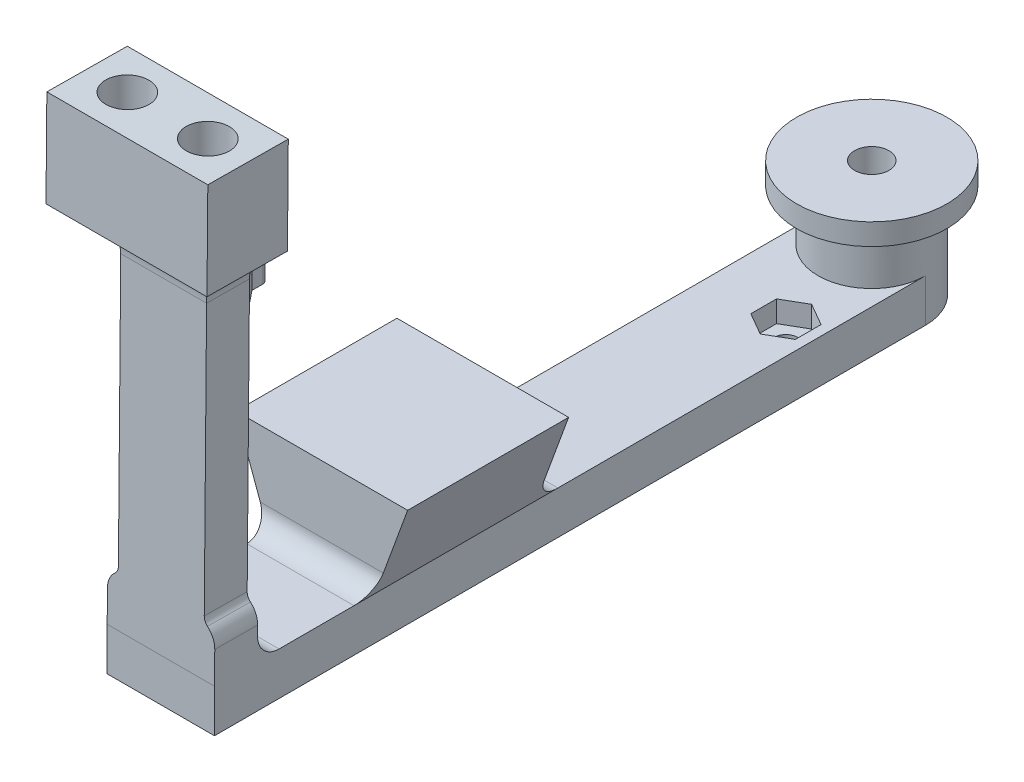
ISO-10303-21;
HEADER;
FILE_DESCRIPTION(('STEP AP214'),'2;1');
FILE_NAME('part.step','',(''),(''),'','','');
FILE_SCHEMA(('AUTOMOTIVE_DESIGN { 1 0 10303 214 1 1 1 1 }'));
ENDSEC;
DATA;
#1=APPLICATION_CONTEXT('core data for automotive mechanical design processes');
#2=APPLICATION_PROTOCOL_DEFINITION('international standard','automotive_design',2000,#1);
#3=PRODUCT_CONTEXT('',#1,'mechanical');
#4=PRODUCT('Part','Part','',(#3));
#5=PRODUCT_RELATED_PRODUCT_CATEGORY('part','',(#4));
#6=PRODUCT_DEFINITION_FORMATION('','',#4);
#7=PRODUCT_DEFINITION_CONTEXT('part definition',#1,'design');
#8=PRODUCT_DEFINITION('design','',#6,#7);
#9=PRODUCT_DEFINITION_SHAPE('','',#8);
#10=(LENGTH_UNIT() NAMED_UNIT(*) SI_UNIT(.MILLI.,.METRE.));
#11=(NAMED_UNIT(*) PLANE_ANGLE_UNIT() SI_UNIT($,.RADIAN.));
#12=(NAMED_UNIT(*) SI_UNIT($,.STERADIAN.) SOLID_ANGLE_UNIT());
#13=UNCERTAINTY_MEASURE_WITH_UNIT(LENGTH_MEASURE(1.E-05),#10,'distance_accuracy_value','');
#14=(GEOMETRIC_REPRESENTATION_CONTEXT(3) GLOBAL_UNCERTAINTY_ASSIGNED_CONTEXT((#13)) GLOBAL_UNIT_ASSIGNED_CONTEXT((#10,
#11,#12)) REPRESENTATION_CONTEXT('',''));
#15=CARTESIAN_POINT('',(0.,0.,0.));
#16=DIRECTION('',(0.,0.,1.));
#17=DIRECTION('',(1.,0.,0.));
#18=AXIS2_PLACEMENT_3D('',#15,#16,#17);
#19=CARTESIAN_POINT('',(5.00000000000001,47.2483531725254,65.8725773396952));
#20=DIRECTION('',(0.,0.00872653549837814,0.999961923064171));
#21=DIRECTION('',(0.,-0.999961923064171,0.00872653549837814));
#22=AXIS2_PLACEMENT_3D('',#19,#20,#21);
#23=PLANE('',#22);
#24=DIRECTION('',(0.,-0.999961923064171,0.00872653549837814));
#25=VECTOR('',#24,1.);
#26=CARTESIAN_POINT('',(4.00000000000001,47.2483531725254,65.8725773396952));
#27=LINE('',#26,#25);
#28=CARTESIAN_POINT('',(4.00000000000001,34.2802200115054,65.9857485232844));
#29=VERTEX_POINT('',#28);
#30=CARTESIAN_POINT('',(4.00000000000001,9.14980390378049,66.2050583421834));
#31=VERTEX_POINT('',#30);
#32=EDGE_CURVE('E658',#29,#31,#27,.T.);
#33=ORIENTED_EDGE('',*,*,#32,.F.);
#34=DIRECTION('',(1.,0.,0.));
#35=VECTOR('',#34,1.);
#36=CARTESIAN_POINT('',(-3.99999999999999,34.2802200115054,65.9857485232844));
#37=LINE('',#36,#35);
#38=CARTESIAN_POINT('',(-3.99999999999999,34.2802200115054,65.9857485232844));
#39=VERTEX_POINT('',#38);
#40=EDGE_CURVE('E691',#29,#39,#37,.F.);
#41=ORIENTED_EDGE('',*,*,#40,.T.);
#42=DIRECTION('',(0.,0.999961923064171,-0.00872653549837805));
#43=VECTOR('',#42,1.);
#44=CARTESIAN_POINT('',(-3.99999999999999,48.2483150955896,65.8638508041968));
#45=LINE('',#44,#43);
#46=CARTESIAN_POINT('',(-3.99999999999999,9.14980390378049,66.2050583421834));
#47=VERTEX_POINT('',#46);
#48=EDGE_CURVE('E561',#47,#39,#45,.T.);
#49=ORIENTED_EDGE('',*,*,#48,.F.);
#50=CARTESIAN_POINT('',(-4.89999999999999,9.14980390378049,66.2050583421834));
#51=DIRECTION('',(0.,0.00872653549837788,0.999961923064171));
#52=DIRECTION('',(0.,-0.999961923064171,0.00872653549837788));
#53=AXIS2_PLACEMENT_3D('',#50,#51,#52);
#54=CIRCLE('',#53,0.9);
#55=CARTESIAN_POINT('',(-4.3103448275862,8.46989834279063,66.2109917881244));
#56=VERTEX_POINT('',#55);
#57=EDGE_CURVE('E558',#56,#47,#54,.T.);
#58=ORIENTED_EDGE('',*,*,#57,.F.);
#59=CARTESIAN_POINT('',(-2.99999999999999,6.95899709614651,66.2241772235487));
#60=DIRECTION('',(0.,0.00872653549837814,0.999961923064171));
#61=DIRECTION('',(0.,-0.999961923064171,0.00872653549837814));
#62=AXIS2_PLACEMENT_3D('',#59,#60,#61);
#63=CIRCLE('',#62,2.);
#64=CARTESIAN_POINT('',(-4.99999999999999,6.95899709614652,66.2241772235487));
#65=VERTEX_POINT('',#64);
#66=EDGE_CURVE('E665',#56,#65,#63,.T.);
#67=ORIENTED_EDGE('',*,*,#66,.T.);
#68=DIRECTION('',(0.,0.999961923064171,-0.00872653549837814));
#69=VECTOR('',#68,1.);
#70=CARTESIAN_POINT('',(-4.99999999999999,47.2483531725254,65.8725773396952));
#71=LINE('',#70,#69);
#72=CARTESIAN_POINT('',(-4.99999999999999,4.,66.25));
#73=VERTEX_POINT('',#72);
#74=EDGE_CURVE('E590',#73,#65,#71,.T.);
#75=ORIENTED_EDGE('',*,*,#74,.F.);
#76=DIRECTION('',(1.,0.,0.));
#77=VECTOR('',#76,1.);
#78=CARTESIAN_POINT('',(-4.99999999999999,4.,66.25));
#79=LINE('',#78,#77);
#80=CARTESIAN_POINT('',(4.99999999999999,4.,66.25));
#81=VERTEX_POINT('',#80);
#82=EDGE_CURVE('E632',#73,#81,#79,.T.);
#83=ORIENTED_EDGE('',*,*,#82,.T.);
#84=DIRECTION('',(0.,0.999961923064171,-0.00872653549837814));
#85=VECTOR('',#84,1.);
#86=CARTESIAN_POINT('',(5.00000000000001,47.2483531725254,65.8725773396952));
#87=LINE('',#86,#85);
#88=CARTESIAN_POINT('',(5.00000000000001,6.95899709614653,66.2241772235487));
#89=VERTEX_POINT('',#88);
#90=EDGE_CURVE('E591',#81,#89,#87,.T.);
#91=ORIENTED_EDGE('',*,*,#90,.T.);
#92=CARTESIAN_POINT('',(3.,6.95899709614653,66.2241772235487));
#93=DIRECTION('',(0.,0.00872653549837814,0.999961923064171));
#94=DIRECTION('',(0.,-0.999961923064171,0.00872653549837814));
#95=AXIS2_PLACEMENT_3D('',#92,#93,#94);
#96=CIRCLE('',#95,2.);
#97=CARTESIAN_POINT('',(4.31034482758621,8.46989834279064,66.2109917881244));
#98=VERTEX_POINT('',#97);
#99=EDGE_CURVE('E668',#89,#98,#96,.T.);
#100=ORIENTED_EDGE('',*,*,#99,.T.);
#101=CARTESIAN_POINT('',(4.9,9.14980390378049,66.2050583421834));
#102=DIRECTION('',(0.,0.00872653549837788,0.999961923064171));
#103=DIRECTION('',(0.,0.999961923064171,-0.00872653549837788));
#104=AXIS2_PLACEMENT_3D('',#101,#102,#103);
#105=CIRCLE('',#104,0.9);
#106=EDGE_CURVE('E562',#31,#98,#105,.T.);
#107=ORIENTED_EDGE('',*,*,#106,.F.);
#108=EDGE_LOOP('',(#33,#41,#49,#58,#67,#75,#83,#91,#100,#107));
#109=FACE_BOUND('',#108,.T.);
#110=ADVANCED_FACE('F57',(#109),#23,.T.);
#111=CARTESIAN_POINT('',(4.00000000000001,48.1610497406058,55.8642315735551));
#112=DIRECTION('',(-1.,0.,0.));
#113=DIRECTION('',(0.,0.,1.));
#114=AXIS2_PLACEMENT_3D('',#111,#112,#113);
#115=PLANE('',#114);
#116=DIRECTION('',(0.,-0.999961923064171,0.00872653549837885));
#117=VECTOR('',#116,1.);
#118=CARTESIAN_POINT('',(4.00000000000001,42.2136374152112,61.9163623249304));
#119=LINE('',#118,#117);
#120=CARTESIAN_POINT('',(4.00000000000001,34.2453138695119,61.9859008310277));
#121=VERTEX_POINT('',#120);
#122=CARTESIAN_POINT('',(4.00000000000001,32.2140181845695,62.0036276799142));
#123=VERTEX_POINT('',#122);
#124=EDGE_CURVE('E535',#121,#123,#119,.T.);
#125=ORIENTED_EDGE('',*,*,#124,.F.);
#126=DIRECTION('',(0.,0.00872653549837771,0.999961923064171));
#127=VECTOR('',#126,1.);
#128=CARTESIAN_POINT('',(4.00000000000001,34.1929546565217,55.9861292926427));
#129=LINE('',#128,#127);
#130=EDGE_CURVE('E687',#121,#29,#129,.T.);
#131=ORIENTED_EDGE('',*,*,#130,.T.);
#132=ORIENTED_EDGE('',*,*,#32,.T.);
#133=DIRECTION('',(0.,0.00872653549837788,0.999961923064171));
#134=VECTOR('',#133,1.);
#135=CARTESIAN_POINT('',(4.,9.06253854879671,56.2054391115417));
#136=LINE('',#135,#134);
#137=CARTESIAN_POINT('',(4.00000000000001,9.11489776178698,62.2052106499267));
#138=VERTEX_POINT('',#137);
#139=EDGE_CURVE('E557',#138,#31,#136,.T.);
#140=ORIENTED_EDGE('',*,*,#139,.F.);
#141=DIRECTION('',(0.,0.999961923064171,-0.00872653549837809));
#142=VECTOR('',#141,1.);
#143=CARTESIAN_POINT('',(4.00000000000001,4.,62.2498476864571));
#144=LINE('',#143,#142);
#145=EDGE_CURVE('E570',#138,#123,#144,.T.);
#146=ORIENTED_EDGE('',*,*,#145,.T.);
#147=EDGE_LOOP('',(#125,#131,#132,#140,#146));
#148=FACE_BOUND('',#147,.T.);
#149=ADVANCED_FACE('F1102',(#148),#115,.F.);
#150=CARTESIAN_POINT('',(-3.99999999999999,48.1610497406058,55.8642315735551));
#151=DIRECTION('',(1.,0.,0.));
#152=DIRECTION('',(0.,0.,-1.));
#153=AXIS2_PLACEMENT_3D('',#150,#151,#152);
#154=PLANE('',#153);
#155=ORIENTED_EDGE('',*,*,#48,.T.);
#156=DIRECTION('',(0.,-0.00872653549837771,-0.999961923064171));
#157=VECTOR('',#156,1.);
#158=CARTESIAN_POINT('',(-3.99999999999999,34.1929546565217,55.9861292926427));
#159=LINE('',#158,#157);
#160=CARTESIAN_POINT('',(-3.99999999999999,34.2453138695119,61.9859008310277));
#161=VERTEX_POINT('',#160);
#162=EDGE_CURVE('E694',#39,#161,#159,.T.);
#163=ORIENTED_EDGE('',*,*,#162,.T.);
#164=DIRECTION('',(0.,-0.999961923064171,0.00872653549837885));
#165=VECTOR('',#164,1.);
#166=CARTESIAN_POINT('',(-3.99999999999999,42.2136374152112,61.9163623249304));
#167=LINE('',#166,#165);
#168=CARTESIAN_POINT('',(-3.99999999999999,32.2140181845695,62.0036276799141));
#169=VERTEX_POINT('',#168);
#170=EDGE_CURVE('E539',#161,#169,#167,.T.);
#171=ORIENTED_EDGE('',*,*,#170,.T.);
#172=DIRECTION('',(0.,-0.999961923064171,0.00872653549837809));
#173=VECTOR('',#172,1.);
#174=CARTESIAN_POINT('',(-3.99999999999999,4.,62.2498476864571));
#175=LINE('',#174,#173);
#176=CARTESIAN_POINT('',(-3.99999999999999,9.11489776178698,62.2052106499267));
#177=VERTEX_POINT('',#176);
#178=EDGE_CURVE('E587',#169,#177,#175,.T.);
#179=ORIENTED_EDGE('',*,*,#178,.T.);
#180=DIRECTION('',(0.,0.00872653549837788,0.999961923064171));
#181=VECTOR('',#180,1.);
#182=CARTESIAN_POINT('',(-3.99999999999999,9.06253854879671,56.2054391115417));
#183=LINE('',#182,#181);
#184=EDGE_CURVE('E566',#177,#47,#183,.T.);
#185=ORIENTED_EDGE('',*,*,#184,.T.);
#186=EDGE_LOOP('',(#155,#163,#171,#179,#185));
#187=FACE_BOUND('',#186,.T.);
#188=ADVANCED_FACE('F754',(#187),#154,.F.);
#189=CARTESIAN_POINT('',(5.00000000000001,4.,62.2498476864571));
#190=DIRECTION('',(0.,-0.00872653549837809,-0.999961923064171));
#191=DIRECTION('',(0.,0.999961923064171,-0.00872653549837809));
#192=AXIS2_PLACEMENT_3D('',#189,#190,#191);
#193=PLANE('',#192);
#194=ORIENTED_EDGE('',*,*,#178,.F.);
#195=DIRECTION('',(1.,0.,0.));
#196=VECTOR('',#195,1.);
#197=CARTESIAN_POINT('',(0.,32.2140181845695,62.0036276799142));
#198=LINE('',#197,#196);
#199=EDGE_CURVE('E517',#169,#123,#198,.T.);
#200=ORIENTED_EDGE('',*,*,#199,.T.);
#201=ORIENTED_EDGE('',*,*,#145,.F.);
#202=CARTESIAN_POINT('',(4.9,9.11489776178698,62.2052106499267));
#203=DIRECTION('',(0.,-0.00872653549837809,-0.999961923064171));
#204=DIRECTION('',(0.,0.999961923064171,-0.00872653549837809));
#205=AXIS2_PLACEMENT_3D('',#202,#203,#204);
#206=CIRCLE('',#205,0.9);
#207=CARTESIAN_POINT('',(4.31034482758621,8.43499220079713,62.2111440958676));
#208=VERTEX_POINT('',#207);
#209=EDGE_CURVE('E580',#208,#138,#206,.T.);
#210=ORIENTED_EDGE('',*,*,#209,.F.);
#211=CARTESIAN_POINT('',(2.99999999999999,6.92409095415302,62.224329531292));
#212=DIRECTION('',(0.,-0.00872653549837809,-0.999961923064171));
#213=DIRECTION('',(0.,0.999961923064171,-0.00872653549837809));
#214=AXIS2_PLACEMENT_3D('',#211,#212,#213);
#215=CIRCLE('',#214,2.);
#216=CARTESIAN_POINT('',(5.00000000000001,6.92409095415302,62.224329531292));
#217=VERTEX_POINT('',#216);
#218=EDGE_CURVE('E677',#208,#217,#215,.T.);
#219=ORIENTED_EDGE('',*,*,#218,.T.);
#220=DIRECTION('',(0.,-0.999961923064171,0.00872653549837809));
#221=VECTOR('',#220,1.);
#222=CARTESIAN_POINT('',(5.00000000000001,4.,62.2498476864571));
#223=LINE('',#222,#221);
#224=CARTESIAN_POINT('',(5.00000000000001,6.01745307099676,62.2322416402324));
#225=VERTEX_POINT('',#224);
#226=EDGE_CURVE('E595',#217,#225,#223,.T.);
#227=ORIENTED_EDGE('',*,*,#226,.T.);
#228=DIRECTION('',(-1.,0.,0.));
#229=VECTOR('',#228,1.);
#230=CARTESIAN_POINT('',(-4.99999999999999,6.01745307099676,62.2322416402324));
#231=LINE('',#230,#229);
#232=CARTESIAN_POINT('',(-4.99999999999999,6.01745307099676,62.2322416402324));
#233=VERTEX_POINT('',#232);
#234=EDGE_CURVE('E646',#225,#233,#231,.T.);
#235=ORIENTED_EDGE('',*,*,#234,.T.);
#236=DIRECTION('',(0.,-0.999961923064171,0.00872653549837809));
#237=VECTOR('',#236,1.);
#238=CARTESIAN_POINT('',(-4.99999999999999,4.,62.2498476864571));
#239=LINE('',#238,#237);
#240=CARTESIAN_POINT('',(-4.99999999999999,6.924090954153,62.224329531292));
#241=VERTEX_POINT('',#240);
#242=EDGE_CURVE('E596',#241,#233,#239,.T.);
#243=ORIENTED_EDGE('',*,*,#242,.F.);
#244=CARTESIAN_POINT('',(-2.99999999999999,6.924090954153,62.224329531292));
#245=DIRECTION('',(0.,-0.00872653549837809,-0.999961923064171));
#246=DIRECTION('',(0.,0.999961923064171,-0.00872653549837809));
#247=AXIS2_PLACEMENT_3D('',#244,#245,#246);
#248=CIRCLE('',#247,2.);
#249=CARTESIAN_POINT('',(-4.3103448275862,8.43499220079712,62.2111440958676));
#250=VERTEX_POINT('',#249);
#251=EDGE_CURVE('E674',#241,#250,#248,.T.);
#252=ORIENTED_EDGE('',*,*,#251,.T.);
#253=CARTESIAN_POINT('',(-4.89999999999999,9.11489776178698,62.2052106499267));
#254=DIRECTION('',(0.,-0.00872653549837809,-0.999961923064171));
#255=DIRECTION('',(0.,0.999961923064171,-0.00872653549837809));
#256=AXIS2_PLACEMENT_3D('',#253,#254,#255);
#257=CIRCLE('',#256,0.9);
#258=EDGE_CURVE('E583',#177,#250,#257,.T.);
#259=ORIENTED_EDGE('',*,*,#258,.F.);
#260=EDGE_LOOP('',(#194,#200,#201,#210,#219,#227,#235,#243,#252,#259));
#261=FACE_BOUND('',#260,.T.);
#262=ADVANCED_FACE('F750',(#261),#193,.T.);
#263=CARTESIAN_POINT('',(0.,4.,0.));
#264=DIRECTION('',(0.,1.,0.));
#265=DIRECTION('',(0.,0.,1.));
#266=AXIS2_PLACEMENT_3D('',#263,#264,#265);
#267=PLANE('',#266);
#268=DIRECTION('',(0.866025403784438,0.,0.500000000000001));
#269=VECTOR('',#268,1.);
#270=CARTESIAN_POINT('',(-4.8676270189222,4.,8.43097730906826));
#271=LINE('',#270,#269);
#272=CARTESIAN_POINT('',(-0.0750000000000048,4.,11.1980018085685));
#273=VERTEX_POINT('',#272);
#274=CARTESIAN_POINT('',(1.99999999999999,4.,12.396003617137));
#275=VERTEX_POINT('',#274);
#276=EDGE_CURVE('E346',#273,#275,#271,.T.);
#277=ORIENTED_EDGE('',*,*,#276,.F.);
#278=DIRECTION('',(0.,0.,1.));
#279=VECTOR('',#278,1.);
#280=CARTESIAN_POINT('',(-0.0750000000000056,4.,0.));
#281=LINE('',#280,#279);
#282=CARTESIAN_POINT('',(-0.0750000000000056,4.,8.80199819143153));
#283=VERTEX_POINT('',#282);
#284=EDGE_CURVE('E354',#283,#273,#281,.T.);
#285=ORIENTED_EDGE('',*,*,#284,.F.);
#286=DIRECTION('',(-0.866025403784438,0.,0.500000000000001));
#287=VECTOR('',#286,1.);
#288=CARTESIAN_POINT('',(3.7926270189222,4.,6.56902269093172));
#289=LINE('',#288,#287);
#290=CARTESIAN_POINT('',(1.99999999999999,4.,7.60399638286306));
#291=VERTEX_POINT('',#290);
#292=EDGE_CURVE('E358',#291,#283,#289,.T.);
#293=ORIENTED_EDGE('',*,*,#292,.F.);
#294=DIRECTION('',(0.866025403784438,0.,0.500000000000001));
#295=VECTOR('',#294,1.);
#296=CARTESIAN_POINT('',(-2.7926270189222,4.,4.83697188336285));
#297=LINE('',#296,#295);
#298=CARTESIAN_POINT('',(4.07499999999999,4.,8.80199819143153));
#299=VERTEX_POINT('',#298);
#300=EDGE_CURVE('E384',#291,#299,#297,.T.);
#301=ORIENTED_EDGE('',*,*,#300,.T.);
#302=DIRECTION('',(0.,0.,1.));
#303=VECTOR('',#302,1.);
#304=CARTESIAN_POINT('',(4.07499999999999,4.,0.));
#305=LINE('',#304,#303);
#306=CARTESIAN_POINT('',(4.07499999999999,4.,11.1980018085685));
#307=VERTEX_POINT('',#306);
#308=EDGE_CURVE('E380',#299,#307,#305,.T.);
#309=ORIENTED_EDGE('',*,*,#308,.T.);
#310=DIRECTION('',(-0.866025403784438,0.,0.500000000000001));
#311=VECTOR('',#310,1.);
#312=CARTESIAN_POINT('',(5.8676270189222,4.,10.1630281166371));
#313=LINE('',#312,#311);
#314=EDGE_CURVE('E376',#307,#275,#313,.T.);
#315=ORIENTED_EDGE('',*,*,#314,.T.);
#316=EDGE_LOOP('',(#277,#285,#293,#301,#309,#315));
#317=FACE_BOUND('',#316,.T.);
#318=DIRECTION('',(0.,0.,1.));
#319=VECTOR('',#318,1.);
#320=CARTESIAN_POINT('',(-5.,4.,0.));
#321=LINE('',#320,#319);
#322=CARTESIAN_POINT('',(-5.,4.,0.));
#323=VERTEX_POINT('',#322);
#324=CARTESIAN_POINT('',(-5.,4.,34.25));
#325=VERTEX_POINT('',#324);
#326=EDGE_CURVE('E866',#323,#325,#321,.T.);
#327=ORIENTED_EDGE('',*,*,#326,.T.);
#328=DIRECTION('',(-1.,0.,0.));
#329=VECTOR('',#328,1.);
#330=CARTESIAN_POINT('',(0.,4.,34.25));
#331=LINE('',#330,#329);
#332=CARTESIAN_POINT('',(4.99999999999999,4.,34.25));
#333=VERTEX_POINT('',#332);
#334=EDGE_CURVE('E625',#325,#333,#331,.F.);
#335=ORIENTED_EDGE('',*,*,#334,.T.);
#336=DIRECTION('',(0.,0.,-1.));
#337=VECTOR('',#336,1.);
#338=CARTESIAN_POINT('',(4.99999999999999,4.,66.25));
#339=LINE('',#338,#337);
#340=CARTESIAN_POINT('',(5.,4.,0.));
#341=VERTEX_POINT('',#340);
#342=EDGE_CURVE('E627',#333,#341,#339,.T.);
#343=ORIENTED_EDGE('',*,*,#342,.T.);
#344=CARTESIAN_POINT('',(0.,4.,0.));
#345=DIRECTION('',(0.,-1.,0.));
#346=DIRECTION('',(0.,0.,1.));
#347=AXIS2_PLACEMENT_3D('',#344,#345,#346);
#348=CIRCLE('',#347,5.);
#349=EDGE_CURVE('E858',#341,#323,#348,.T.);
#350=ORIENTED_EDGE('',*,*,#349,.T.);
#351=EDGE_LOOP('',(#327,#335,#343,#350));
#352=FACE_BOUND('',#351,.T.);
#353=ADVANCED_FACE('F1066',(#317,#352),#267,.T.);
#354=CARTESIAN_POINT('',(-5.,4.,53.25));
#355=VERTEX_POINT('',#354);
#356=CARTESIAN_POINT('',(-4.99999999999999,4.,60.2323177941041));
#357=VERTEX_POINT('',#356);
#358=EDGE_CURVE('E862',#355,#357,#321,.T.);
#359=ORIENTED_EDGE('',*,*,#358,.T.);
#360=DIRECTION('',(-1.,0.,0.));
#361=VECTOR('',#360,1.);
#362=CARTESIAN_POINT('',(5.00000000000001,4.,60.2323177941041));
#363=LINE('',#362,#361);
#364=CARTESIAN_POINT('',(4.99999999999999,4.,60.2323177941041));
#365=VERTEX_POINT('',#364);
#366=EDGE_CURVE('E648',#357,#365,#363,.F.);
#367=ORIENTED_EDGE('',*,*,#366,.T.);
#368=CARTESIAN_POINT('',(4.99999999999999,4.,53.25));
#369=VERTEX_POINT('',#368);
#370=EDGE_CURVE('E631',#365,#369,#339,.T.);
#371=ORIENTED_EDGE('',*,*,#370,.T.);
#372=DIRECTION('',(1.,0.,0.));
#373=VECTOR('',#372,1.);
#374=CARTESIAN_POINT('',(0.,4.,53.25));
#375=LINE('',#374,#373);
#376=EDGE_CURVE('E907',#369,#355,#375,.F.);
#377=ORIENTED_EDGE('',*,*,#376,.T.);
#378=EDGE_LOOP('',(#359,#367,#371,#377));
#379=FACE_BOUND('',#378,.T.);
#380=ADVANCED_FACE('F940',(#379),#267,.T.);
#381=CARTESIAN_POINT('',(0.,10.8,0.));
#382=DIRECTION('',(0.,-1.,0.));
#383=DIRECTION('',(0.,0.,-1.));
#384=AXIS2_PLACEMENT_3D('',#381,#382,#383);
#385=CYLINDRICAL_SURFACE('',#384,5.);
#386=DIRECTION('',(0.,-1.,0.));
#387=VECTOR('',#386,1.);
#388=CARTESIAN_POINT('',(-5.,4.,0.));
#389=LINE('',#388,#387);
#390=CARTESIAN_POINT('',(-5.,0.,0.));
#391=VERTEX_POINT('',#390);
#392=EDGE_CURVE('E883',#323,#391,#389,.T.);
#393=ORIENTED_EDGE('',*,*,#392,.F.);
#394=ORIENTED_EDGE('',*,*,#349,.F.);
#395=DIRECTION('',(0.,-1.,0.));
#396=VECTOR('',#395,1.);
#397=CARTESIAN_POINT('',(5.,4.,0.));
#398=LINE('',#397,#396);
#399=CARTESIAN_POINT('',(5.,0.,0.));
#400=VERTEX_POINT('',#399);
#401=EDGE_CURVE('E645',#341,#400,#398,.T.);
#402=ORIENTED_EDGE('',*,*,#401,.T.);
#403=CARTESIAN_POINT('',(0.,0.,0.));
#404=DIRECTION('',(0.,1.,0.));
#405=DIRECTION('',(0.,0.,1.));
#406=AXIS2_PLACEMENT_3D('',#403,#404,#405);
#407=CIRCLE('',#406,5.);
#408=EDGE_CURVE('E895',#400,#391,#407,.T.);
#409=ORIENTED_EDGE('',*,*,#408,.T.);
#410=EDGE_LOOP('',(#393,#394,#402,#409));
#411=FACE_BOUND('',#410,.T.);
#412=CARTESIAN_POINT('',(0.,8.8,0.));
#413=DIRECTION('',(0.,1.,0.));
#414=DIRECTION('',(0.,0.,1.));
#415=AXIS2_PLACEMENT_3D('',#412,#413,#414);
#416=CIRCLE('',#415,5.);
#417=CARTESIAN_POINT('',(0.,8.8,5.));
#418=VERTEX_POINT('',#417);
#419=EDGE_CURVE('E626',#418,#418,#416,.T.);
#420=ORIENTED_EDGE('',*,*,#419,.F.);
#421=EDGE_LOOP('',(#420));
#422=FACE_BOUND('',#421,.T.);
#423=ADVANCED_FACE('F1074',(#411,#422),#385,.T.);
#424=CARTESIAN_POINT('',(0.,10.8,0.));
#425=DIRECTION('',(0.,1.,0.));
#426=DIRECTION('',(0.,0.,1.));
#427=AXIS2_PLACEMENT_3D('',#424,#425,#426);
#428=PLANE('',#427);
#429=CARTESIAN_POINT('',(0.,10.8,0.));
#430=DIRECTION('',(0.,1.,0.));
#431=DIRECTION('',(0.,0.,1.));
#432=AXIS2_PLACEMENT_3D('',#429,#430,#431);
#433=CIRCLE('',#432,1.6);
#434=CARTESIAN_POINT('',(0.,10.8,-1.6));
#435=VERTEX_POINT('',#434);
#436=EDGE_CURVE('E891',#435,#435,#433,.T.);
#437=ORIENTED_EDGE('',*,*,#436,.F.);
#438=EDGE_LOOP('',(#437));
#439=FACE_BOUND('',#438,.T.);
#440=CARTESIAN_POINT('',(0.,10.8,0.));
#441=DIRECTION('',(0.,1.,0.));
#442=DIRECTION('',(0.,0.,1.));
#443=AXIS2_PLACEMENT_3D('',#440,#441,#442);
#444=CIRCLE('',#443,7.);
#445=CARTESIAN_POINT('',(0.,10.8,7.));
#446=VERTEX_POINT('',#445);
#447=EDGE_CURVE('E843',#446,#446,#444,.T.);
#448=ORIENTED_EDGE('',*,*,#447,.T.);
#449=EDGE_LOOP('',(#448));
#450=FACE_BOUND('',#449,.T.);
#451=ADVANCED_FACE('F1086',(#439,#450),#428,.T.);
#452=CARTESIAN_POINT('',(0.,0.,0.));
#453=DIRECTION('',(0.,1.,0.));
#454=DIRECTION('',(0.,0.,1.));
#455=AXIS2_PLACEMENT_3D('',#452,#453,#454);
#456=PLANE('',#455);
#457=CARTESIAN_POINT('',(1.99999999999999,0.,10.));
#458=DIRECTION('',(0.,1.,0.));
#459=DIRECTION('',(0.,0.,1.));
#460=AXIS2_PLACEMENT_3D('',#457,#458,#459);
#461=CIRCLE('',#460,1.075);
#462=CARTESIAN_POINT('',(1.99999999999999,0.,11.075));
#463=VERTEX_POINT('',#462);
#464=EDGE_CURVE('E377',#463,#463,#461,.T.);
#465=ORIENTED_EDGE('',*,*,#464,.T.);
#466=EDGE_LOOP('',(#465));
#467=FACE_BOUND('',#466,.T.);
#468=ORIENTED_EDGE('',*,*,#408,.F.);
#469=DIRECTION('',(0.,0.,-1.));
#470=VECTOR('',#469,1.);
#471=CARTESIAN_POINT('',(4.99999999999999,0.,66.25));
#472=LINE('',#471,#470);
#473=CARTESIAN_POINT('',(4.99999999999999,0.,66.25));
#474=VERTEX_POINT('',#473);
#475=EDGE_CURVE('E855',#474,#400,#472,.T.);
#476=ORIENTED_EDGE('',*,*,#475,.F.);
#477=DIRECTION('',(1.,0.,0.));
#478=VECTOR('',#477,1.);
#479=CARTESIAN_POINT('',(-4.99999999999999,0.,66.25));
#480=LINE('',#479,#478);
#481=CARTESIAN_POINT('',(-4.99999999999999,0.,66.25));
#482=VERTEX_POINT('',#481);
#483=EDGE_CURVE('E853',#482,#474,#480,.T.);
#484=ORIENTED_EDGE('',*,*,#483,.F.);
#485=DIRECTION('',(0.,0.,1.));
#486=VECTOR('',#485,1.);
#487=CARTESIAN_POINT('',(-5.,0.,0.));
#488=LINE('',#487,#486);
#489=EDGE_CURVE('E638',#391,#482,#488,.T.);
#490=ORIENTED_EDGE('',*,*,#489,.F.);
#491=EDGE_LOOP('',(#468,#476,#484,#490));
#492=FACE_BOUND('',#491,.T.);
#493=CARTESIAN_POINT('',(0.,0.,0.));
#494=DIRECTION('',(0.,1.,0.));
#495=DIRECTION('',(0.,0.,1.));
#496=AXIS2_PLACEMENT_3D('',#493,#494,#495);
#497=CIRCLE('',#496,1.6);
#498=CARTESIAN_POINT('',(0.,0.,-1.6));
#499=VERTEX_POINT('',#498);
#500=EDGE_CURVE('E887',#499,#499,#497,.T.);
#501=ORIENTED_EDGE('',*,*,#500,.T.);
#502=EDGE_LOOP('',(#501));
#503=FACE_BOUND('',#502,.T.);
#504=ADVANCED_FACE('F1082',(#467,#492,#503),#456,.F.);
#505=CARTESIAN_POINT('',(0.,10.8,0.));
#506=DIRECTION('',(0.,-1.,0.));
#507=DIRECTION('',(0.,0.,-1.));
#508=AXIS2_PLACEMENT_3D('',#505,#506,#507);
#509=CYLINDRICAL_SURFACE('',#508,1.6);
#510=CARTESIAN_POINT('',(0.,10.8,-1.6));
#511=CARTESIAN_POINT('',(0.,10.6875,-1.6));
#512=CARTESIAN_POINT('',(0.,10.575,-1.6));
#513=CARTESIAN_POINT('',(0.,10.35,-1.6));
#514=CARTESIAN_POINT('',(0.,10.2375,-1.6));
#515=CARTESIAN_POINT('',(0.,10.0125,-1.6));
#516=CARTESIAN_POINT('',(0.,9.9,-1.6));
#517=CARTESIAN_POINT('',(0.,9.675,-1.6));
#518=CARTESIAN_POINT('',(0.,9.5625,-1.6));
#519=CARTESIAN_POINT('',(0.,9.3375,-1.6));
#520=CARTESIAN_POINT('',(0.,9.225,-1.6));
#521=CARTESIAN_POINT('',(0.,9.,-1.6));
#522=CARTESIAN_POINT('',(0.,8.8875,-1.6));
#523=CARTESIAN_POINT('',(0.,8.6625,-1.6));
#524=CARTESIAN_POINT('',(0.,8.55,-1.6));
#525=CARTESIAN_POINT('',(0.,8.325,-1.6));
#526=CARTESIAN_POINT('',(0.,8.2125,-1.6));
#527=CARTESIAN_POINT('',(0.,7.9875,-1.6));
#528=CARTESIAN_POINT('',(0.,7.875,-1.6));
#529=CARTESIAN_POINT('',(0.,7.65,-1.6));
#530=CARTESIAN_POINT('',(0.,7.5375,-1.6));
#531=CARTESIAN_POINT('',(0.,7.3125,-1.6));
#532=CARTESIAN_POINT('',(0.,7.2,-1.6));
#533=CARTESIAN_POINT('',(0.,6.975,-1.6));
#534=CARTESIAN_POINT('',(0.,6.8625,-1.6));
#535=CARTESIAN_POINT('',(0.,6.6375,-1.6));
#536=CARTESIAN_POINT('',(0.,6.525,-1.6));
#537=CARTESIAN_POINT('',(0.,6.3,-1.6));
#538=CARTESIAN_POINT('',(0.,6.1875,-1.6));
#539=CARTESIAN_POINT('',(0.,5.9625,-1.6));
#540=CARTESIAN_POINT('',(0.,5.85,-1.6));
#541=CARTESIAN_POINT('',(0.,5.625,-1.6));
#542=CARTESIAN_POINT('',(0.,5.5125,-1.6));
#543=CARTESIAN_POINT('',(0.,5.2875,-1.6));
#544=CARTESIAN_POINT('',(0.,5.175,-1.6));
#545=CARTESIAN_POINT('',(0.,4.95,-1.6));
#546=CARTESIAN_POINT('',(0.,4.8375,-1.6));
#547=CARTESIAN_POINT('',(0.,4.6125,-1.6));
#548=CARTESIAN_POINT('',(0.,4.5,-1.6));
#549=CARTESIAN_POINT('',(0.,4.275,-1.6));
#550=CARTESIAN_POINT('',(0.,4.1625,-1.6));
#551=CARTESIAN_POINT('',(0.,3.9375,-1.6));
#552=CARTESIAN_POINT('',(0.,3.825,-1.6));
#553=CARTESIAN_POINT('',(0.,3.6,-1.6));
#554=CARTESIAN_POINT('',(0.,3.4875,-1.6));
#555=CARTESIAN_POINT('',(0.,3.2625,-1.6));
#556=CARTESIAN_POINT('',(0.,3.15,-1.6));
#557=CARTESIAN_POINT('',(0.,2.925,-1.6));
#558=CARTESIAN_POINT('',(0.,2.8125,-1.6));
#559=CARTESIAN_POINT('',(0.,2.5875,-1.6));
#560=CARTESIAN_POINT('',(0.,2.475,-1.6));
#561=CARTESIAN_POINT('',(0.,2.25,-1.6));
#562=CARTESIAN_POINT('',(0.,2.1375,-1.6));
#563=CARTESIAN_POINT('',(0.,1.9125,-1.6));
#564=CARTESIAN_POINT('',(0.,1.8,-1.6));
#565=CARTESIAN_POINT('',(0.,1.575,-1.6));
#566=CARTESIAN_POINT('',(0.,1.4625,-1.6));
#567=CARTESIAN_POINT('',(0.,1.2375,-1.6));
#568=CARTESIAN_POINT('',(0.,1.125,-1.6));
#569=CARTESIAN_POINT('',(0.,0.899999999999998,-1.6));
#570=CARTESIAN_POINT('',(0.,0.787499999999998,-1.6));
#571=CARTESIAN_POINT('',(0.,0.562499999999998,-1.6));
#572=CARTESIAN_POINT('',(0.,0.449999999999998,-1.6));
#573=CARTESIAN_POINT('',(0.,0.224999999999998,-1.6));
#574=CARTESIAN_POINT('',(0.,0.112499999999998,-1.6));
#575=CARTESIAN_POINT('',(0.,0.,-1.6));
#576=B_SPLINE_CURVE_WITH_KNOTS('',3,(#510,#511,#512,#513,#514,#515,#516,#517,#518,#519,#520,
#521,#522,#523,#524,#525,#526,#527,#528,#529,#530,#531,#532,#533,#534,#535,#536,#537,#538,#539,
#540,#541,#542,#543,#544,#545,#546,#547,#548,#549,#550,#551,#552,#553,#554,#555,#556,#557,#558,
#559,#560,#561,#562,#563,#564,#565,#566,#567,#568,#569,#570,#571,#572,#573,#574,#575),
.UNSPECIFIED.,.F.,.F.,(4,2,2,2,2,2,2,2,2,2,2,2,2,2,2,2,2,2,2,2,2,2,2,2,2,2,2,2,2,2,2,2,4),(0.,
0.337499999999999,0.674999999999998,1.0125,1.35,1.6875,2.025,2.3625,2.7,3.0375,3.375,3.7125,
4.05,4.3875,4.725,5.0625,5.4,5.7375,6.075,6.4125,6.75,7.0875,7.425,7.7625,8.1,8.4375,8.775,
9.1125,9.45,9.7875,10.125,10.4625,10.8),.UNSPECIFIED.);
#577=EDGE_CURVE('BSEAM1085',#435,#499,#576,.T.);
#578=ORIENTED_EDGE('',*,*,#436,.T.);
#579=ORIENTED_EDGE('',*,*,#500,.F.);
#580=ORIENTED_EDGE('',*,*,#577,.T.);
#581=ORIENTED_EDGE('',*,*,#577,.F.);
#582=EDGE_LOOP('',(#578,#580,#579,#581));
#583=FACE_BOUND('',#582,.T.);
#584=ADVANCED_FACE('F1085',(#583),#509,.F.);
#585=CARTESIAN_POINT('',(-5.,4.,0.));
#586=DIRECTION('',(1.,0.,0.));
#587=DIRECTION('',(0.,0.,-1.));
#588=AXIS2_PLACEMENT_3D('',#585,#586,#587);
#589=PLANE('',#588);
#590=ORIENTED_EDGE('',*,*,#74,.T.);
#591=DIRECTION('',(0.,0.00872653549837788,0.999961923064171));
#592=VECTOR('',#591,1.);
#593=CARTESIAN_POINT('',(-5.,6.38088613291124,-0.0207776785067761));
#594=LINE('',#593,#592);
#595=EDGE_CURVE('E684',#65,#241,#594,.F.);
#596=ORIENTED_EDGE('',*,*,#595,.T.);
#597=ORIENTED_EDGE('',*,*,#242,.T.);
#598=CARTESIAN_POINT('',(-4.99999999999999,6.,60.2323177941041));
#599=DIRECTION('',(1.,0.,0.));
#600=DIRECTION('',(0.,0.,-1.));
#601=AXIS2_PLACEMENT_3D('',#598,#599,#600);
#602=CIRCLE('',#601,2.);
#603=EDGE_CURVE('E651',#233,#357,#602,.T.);
#604=ORIENTED_EDGE('',*,*,#603,.T.);
#605=ORIENTED_EDGE('',*,*,#358,.F.);
#606=DIRECTION('',(0.,0.,1.));
#607=VECTOR('',#606,1.);
#608=CARTESIAN_POINT('',(-5.,4.,36.25));
#609=LINE('',#608,#607);
#610=EDGE_CURVE('E607',#325,#355,#609,.T.);
#611=ORIENTED_EDGE('',*,*,#610,.F.);
#612=ORIENTED_EDGE('',*,*,#326,.F.);
#613=ORIENTED_EDGE('',*,*,#392,.T.);
#614=ORIENTED_EDGE('',*,*,#489,.T.);
#615=DIRECTION('',(0.,-1.,0.));
#616=VECTOR('',#615,1.);
#617=CARTESIAN_POINT('',(-4.99999999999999,4.,66.25));
#618=LINE('',#617,#616);
#619=EDGE_CURVE('E879',#73,#482,#618,.T.);
#620=ORIENTED_EDGE('',*,*,#619,.F.);
#621=EDGE_LOOP('',(#590,#596,#597,#604,#605,#611,#612,#613,#614,#620));
#622=FACE_BOUND('',#621,.T.);
#623=ADVANCED_FACE('F937',(#622),#589,.F.);
#624=CARTESIAN_POINT('',(-4.99999999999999,4.,66.25));
#625=DIRECTION('',(0.,0.,-1.));
#626=DIRECTION('',(-1.,0.,0.));
#627=AXIS2_PLACEMENT_3D('',#624,#625,#626);
#628=PLANE('',#627);
#629=ORIENTED_EDGE('',*,*,#483,.T.);
#630=DIRECTION('',(0.,-1.,0.));
#631=VECTOR('',#630,1.);
#632=CARTESIAN_POINT('',(4.99999999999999,4.,66.25));
#633=LINE('',#632,#631);
#634=EDGE_CURVE('E875',#81,#474,#633,.T.);
#635=ORIENTED_EDGE('',*,*,#634,.F.);
#636=ORIENTED_EDGE('',*,*,#82,.F.);
#637=ORIENTED_EDGE('',*,*,#619,.T.);
#638=EDGE_LOOP('',(#629,#635,#636,#637));
#639=FACE_BOUND('',#638,.T.);
#640=ADVANCED_FACE('F1081',(#639),#628,.F.);
#641=CARTESIAN_POINT('',(4.99999999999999,4.,66.25));
#642=DIRECTION('',(-1.,0.,0.));
#643=DIRECTION('',(0.,0.,1.));
#644=AXIS2_PLACEMENT_3D('',#641,#642,#643);
#645=PLANE('',#644);
#646=ORIENTED_EDGE('',*,*,#226,.F.);
#647=DIRECTION('',(0.,0.00872653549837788,0.999961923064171));
#648=VECTOR('',#647,1.);
#649=CARTESIAN_POINT('',(4.99999999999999,6.95899709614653,66.2241772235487));
#650=LINE('',#649,#648);
#651=EDGE_CURVE('E661',#217,#89,#650,.T.);
#652=ORIENTED_EDGE('',*,*,#651,.T.);
#653=ORIENTED_EDGE('',*,*,#90,.F.);
#654=ORIENTED_EDGE('',*,*,#634,.T.);
#655=ORIENTED_EDGE('',*,*,#475,.T.);
#656=ORIENTED_EDGE('',*,*,#401,.F.);
#657=ORIENTED_EDGE('',*,*,#342,.F.);
#658=DIRECTION('',(0.,0.,-1.));
#659=VECTOR('',#658,1.);
#660=CARTESIAN_POINT('',(4.99999999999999,4.,36.25));
#661=LINE('',#660,#659);
#662=EDGE_CURVE('E820',#369,#333,#661,.T.);
#663=ORIENTED_EDGE('',*,*,#662,.F.);
#664=ORIENTED_EDGE('',*,*,#370,.F.);
#665=CARTESIAN_POINT('',(4.99999999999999,6.,60.2323177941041));
#666=DIRECTION('',(-1.,0.,0.));
#667=DIRECTION('',(0.,0.,1.));
#668=AXIS2_PLACEMENT_3D('',#665,#666,#667);
#669=CIRCLE('',#668,2.);
#670=EDGE_CURVE('E654',#365,#225,#669,.T.);
#671=ORIENTED_EDGE('',*,*,#670,.T.);
#672=EDGE_LOOP('',(#646,#652,#653,#654,#655,#656,#657,#663,#664,#671));
#673=FACE_BOUND('',#672,.T.);
#674=ADVANCED_FACE('F1071',(#673),#645,.F.);
#675=CARTESIAN_POINT('',(0.,8.8,0.));
#676=DIRECTION('',(0.,1.,0.));
#677=DIRECTION('',(0.,0.,1.));
#678=AXIS2_PLACEMENT_3D('',#675,#676,#677);
#679=PLANE('',#678);
#680=CARTESIAN_POINT('',(0.,8.8,0.));
#681=DIRECTION('',(0.,1.,0.));
#682=DIRECTION('',(0.,0.,1.));
#683=AXIS2_PLACEMENT_3D('',#680,#681,#682);
#684=CIRCLE('',#683,7.);
#685=CARTESIAN_POINT('',(0.,8.8,7.));
#686=VERTEX_POINT('',#685);
#687=EDGE_CURVE('E847',#686,#686,#684,.T.);
#688=ORIENTED_EDGE('',*,*,#687,.F.);
#689=EDGE_LOOP('',(#688));
#690=FACE_BOUND('',#689,.T.);
#691=ORIENTED_EDGE('',*,*,#419,.T.);
#692=EDGE_LOOP('',(#691));
#693=FACE_BOUND('',#692,.T.);
#694=ADVANCED_FACE('F986',(#690,#693),#679,.F.);
#695=CARTESIAN_POINT('',(0.,8.8,0.));
#696=DIRECTION('',(0.,1.,0.));
#697=DIRECTION('',(0.,0.,1.));
#698=AXIS2_PLACEMENT_3D('',#695,#696,#697);
#699=CYLINDRICAL_SURFACE('',#698,7.);
#700=ORIENTED_EDGE('',*,*,#687,.T.);
#701=EDGE_LOOP('',(#700));
#702=FACE_BOUND('',#701,.T.);
#703=ORIENTED_EDGE('',*,*,#447,.F.);
#704=EDGE_LOOP('',(#703));
#705=FACE_BOUND('',#704,.T.);
#706=ADVANCED_FACE('F982',(#702,#705),#699,.T.);
#707=CARTESIAN_POINT('',(0.,12.2,0.));
#708=DIRECTION('',(0.,1.,0.));
#709=DIRECTION('',(0.,0.,1.));
#710=AXIS2_PLACEMENT_3D('',#707,#708,#709);
#711=PLANE('',#710);
#712=DIRECTION('',(0.,0.,1.));
#713=VECTOR('',#712,1.);
#714=CARTESIAN_POINT('',(-8.,12.2,36.25));
#715=LINE('',#714,#713);
#716=CARTESIAN_POINT('',(-8.,12.2,36.25));
#717=VERTEX_POINT('',#716);
#718=CARTESIAN_POINT('',(-8.,12.2,51.25));
#719=VERTEX_POINT('',#718);
#720=EDGE_CURVE('E617',#717,#719,#715,.T.);
#721=ORIENTED_EDGE('',*,*,#720,.T.);
#722=DIRECTION('',(1.,0.,0.));
#723=VECTOR('',#722,1.);
#724=CARTESIAN_POINT('',(-8.,12.2,51.25));
#725=LINE('',#724,#723);
#726=CARTESIAN_POINT('',(7.99999999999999,12.2,51.25));
#727=VERTEX_POINT('',#726);
#728=EDGE_CURVE('E831',#719,#727,#725,.T.);
#729=ORIENTED_EDGE('',*,*,#728,.T.);
#730=DIRECTION('',(0.,0.,-1.));
#731=VECTOR('',#730,1.);
#732=CARTESIAN_POINT('',(7.99999999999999,12.2,36.25));
#733=LINE('',#732,#731);
#734=CARTESIAN_POINT('',(7.99999999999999,12.2,36.25));
#735=VERTEX_POINT('',#734);
#736=EDGE_CURVE('E835',#727,#735,#733,.T.);
#737=ORIENTED_EDGE('',*,*,#736,.T.);
#738=DIRECTION('',(-1.,0.,0.));
#739=VECTOR('',#738,1.);
#740=CARTESIAN_POINT('',(-8.,12.2,36.25));
#741=LINE('',#740,#739);
#742=EDGE_CURVE('E839',#735,#717,#741,.T.);
#743=ORIENTED_EDGE('',*,*,#742,.T.);
#744=EDGE_LOOP('',(#721,#729,#737,#743));
#745=FACE_BOUND('',#744,.T.);
#746=ADVANCED_FACE('F962',(#745),#711,.T.);
#747=CARTESIAN_POINT('',(-3.11909758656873,-1.14113326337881,0.));
#748=DIRECTION('',(0.939122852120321,0.343581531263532,0.));
#749=DIRECTION('',(-0.343581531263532,0.939122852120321,0.));
#750=AXIS2_PLACEMENT_3D('',#747,#748,#749);
#751=PLANE('',#750);
#752=ORIENTED_EDGE('',*,*,#610,.T.);
#753=CARTESIAN_POINT('',(-5.73170731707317,6.,53.25));
#754=DIRECTION('',(0.939122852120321,0.343581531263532,0.));
#755=DIRECTION('',(0.343581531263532,-0.939122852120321,0.));
#756=AXIS2_PLACEMENT_3D('',#753,#754,#755);
#757=ELLIPSE('',#756,2.12964682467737,2.);
#758=CARTESIAN_POINT('',(-5.73170731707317,6.,51.25));
#759=VERTEX_POINT('',#758);
#760=EDGE_CURVE('E922',#355,#759,#757,.T.);
#761=ORIENTED_EDGE('',*,*,#760,.T.);
#762=DIRECTION('',(-0.343581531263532,0.939122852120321,0.));
#763=VECTOR('',#762,1.);
#764=CARTESIAN_POINT('',(-5.,4.,51.25));
#765=LINE('',#764,#763);
#766=EDGE_CURVE('E823',#759,#719,#765,.T.);
#767=ORIENTED_EDGE('',*,*,#766,.T.);
#768=ORIENTED_EDGE('',*,*,#720,.F.);
#769=DIRECTION('',(-0.343581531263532,0.939122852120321,0.));
#770=VECTOR('',#769,1.);
#771=CARTESIAN_POINT('',(-5.,4.,36.25));
#772=LINE('',#771,#770);
#773=CARTESIAN_POINT('',(-5.73170731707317,6.,36.25));
#774=VERTEX_POINT('',#773);
#775=EDGE_CURVE('E619',#774,#717,#772,.T.);
#776=ORIENTED_EDGE('',*,*,#775,.F.);
#777=CARTESIAN_POINT('',(-5.73170731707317,6.,34.25));
#778=DIRECTION('',(0.939122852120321,0.343581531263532,0.));
#779=DIRECTION('',(-0.343581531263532,0.939122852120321,0.));
#780=AXIS2_PLACEMENT_3D('',#777,#778,#779);
#781=ELLIPSE('',#780,2.12964682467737,2.);
#782=EDGE_CURVE('E911',#774,#325,#781,.T.);
#783=ORIENTED_EDGE('',*,*,#782,.T.);
#784=EDGE_LOOP('',(#752,#761,#767,#768,#776,#783));
#785=FACE_BOUND('',#784,.T.);
#786=ADVANCED_FACE('F949',(#785),#751,.F.);
#787=CARTESIAN_POINT('',(0.,0.,36.25));
#788=DIRECTION('',(0.,0.,1.));
#789=DIRECTION('',(1.,0.,0.));
#790=AXIS2_PLACEMENT_3D('',#787,#788,#789);
#791=PLANE('',#790);
#792=DIRECTION('',(0.343581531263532,0.939122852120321,0.));
#793=VECTOR('',#792,1.);
#794=CARTESIAN_POINT('',(4.99999999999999,4.,36.25));
#795=LINE('',#794,#793);
#796=CARTESIAN_POINT('',(5.73170731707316,6.,36.25));
#797=VERTEX_POINT('',#796);
#798=EDGE_CURVE('E613',#797,#735,#795,.T.);
#799=ORIENTED_EDGE('',*,*,#798,.F.);
#800=DIRECTION('',(-1.,0.,0.));
#801=VECTOR('',#800,1.);
#802=CARTESIAN_POINT('',(0.,6.,36.25));
#803=LINE('',#802,#801);
#804=EDGE_CURVE('E621',#797,#774,#803,.T.);
#805=ORIENTED_EDGE('',*,*,#804,.T.);
#806=ORIENTED_EDGE('',*,*,#775,.T.);
#807=ORIENTED_EDGE('',*,*,#742,.F.);
#808=EDGE_LOOP('',(#799,#805,#806,#807));
#809=FACE_BOUND('',#808,.T.);
#810=ADVANCED_FACE('F1028',(#809),#791,.F.);
#811=CARTESIAN_POINT('',(0.,0.,51.25));
#812=DIRECTION('',(0.,0.,-1.));
#813=DIRECTION('',(-1.,0.,0.));
#814=AXIS2_PLACEMENT_3D('',#811,#812,#813);
#815=PLANE('',#814);
#816=ORIENTED_EDGE('',*,*,#766,.F.);
#817=DIRECTION('',(1.,0.,0.));
#818=VECTOR('',#817,1.);
#819=CARTESIAN_POINT('',(0.,6.,51.25));
#820=LINE('',#819,#818);
#821=CARTESIAN_POINT('',(5.73170731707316,6.,51.25));
#822=VERTEX_POINT('',#821);
#823=EDGE_CURVE('E904',#759,#822,#820,.T.);
#824=ORIENTED_EDGE('',*,*,#823,.T.);
#825=DIRECTION('',(0.343581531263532,0.939122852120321,0.));
#826=VECTOR('',#825,1.);
#827=CARTESIAN_POINT('',(4.99999999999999,4.,51.25));
#828=LINE('',#827,#826);
#829=EDGE_CURVE('E618',#822,#727,#828,.T.);
#830=ORIENTED_EDGE('',*,*,#829,.T.);
#831=ORIENTED_EDGE('',*,*,#728,.F.);
#832=EDGE_LOOP('',(#816,#824,#830,#831));
#833=FACE_BOUND('',#832,.T.);
#834=ADVANCED_FACE('F953',(#833),#815,.F.);
#835=CARTESIAN_POINT('',(3.11909758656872,-1.1411332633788,0.));
#836=DIRECTION('',(-0.939122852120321,0.343581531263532,0.));
#837=DIRECTION('',(-0.343581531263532,-0.939122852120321,0.));
#838=AXIS2_PLACEMENT_3D('',#835,#836,#837);
#839=PLANE('',#838);
#840=ORIENTED_EDGE('',*,*,#662,.T.);
#841=CARTESIAN_POINT('',(5.73170731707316,6.,34.25));
#842=DIRECTION('',(-0.939122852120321,0.343581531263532,0.));
#843=DIRECTION('',(-0.343581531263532,-0.939122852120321,0.));
#844=AXIS2_PLACEMENT_3D('',#841,#842,#843);
#845=ELLIPSE('',#844,2.12964682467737,2.);
#846=EDGE_CURVE('E915',#333,#797,#845,.T.);
#847=ORIENTED_EDGE('',*,*,#846,.T.);
#848=ORIENTED_EDGE('',*,*,#798,.T.);
#849=ORIENTED_EDGE('',*,*,#736,.F.);
#850=ORIENTED_EDGE('',*,*,#829,.F.);
#851=CARTESIAN_POINT('',(5.73170731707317,6.,53.25));
#852=DIRECTION('',(-0.939122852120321,0.343581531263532,0.));
#853=DIRECTION('',(0.343581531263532,0.939122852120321,0.));
#854=AXIS2_PLACEMENT_3D('',#851,#852,#853);
#855=ELLIPSE('',#854,2.12964682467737,2.);
#856=EDGE_CURVE('E918',#822,#369,#855,.T.);
#857=ORIENTED_EDGE('',*,*,#856,.T.);
#858=EDGE_LOOP('',(#840,#847,#848,#849,#850,#857));
#859=FACE_BOUND('',#858,.T.);
#860=ADVANCED_FACE('F983',(#859),#839,.F.);
#861=CARTESIAN_POINT('',(0.,6.,34.25));
#862=DIRECTION('',(-1.,0.,0.));
#863=DIRECTION('',(0.,0.,1.));
#864=AXIS2_PLACEMENT_3D('',#861,#862,#863);
#865=CYLINDRICAL_SURFACE('',#864,2.);
#866=ORIENTED_EDGE('',*,*,#846,.F.);
#867=ORIENTED_EDGE('',*,*,#334,.F.);
#868=ORIENTED_EDGE('',*,*,#782,.F.);
#869=ORIENTED_EDGE('',*,*,#804,.F.);
#870=EDGE_LOOP('',(#866,#867,#868,#869));
#871=FACE_BOUND('',#870,.T.);
#872=ADVANCED_FACE('F1063',(#871),#865,.F.);
#873=CARTESIAN_POINT('',(0.,6.,53.25));
#874=DIRECTION('',(1.,0.,0.));
#875=DIRECTION('',(0.,0.,-1.));
#876=AXIS2_PLACEMENT_3D('',#873,#874,#875);
#877=CYLINDRICAL_SURFACE('',#876,2.);
#878=ORIENTED_EDGE('',*,*,#760,.F.);
#879=ORIENTED_EDGE('',*,*,#376,.F.);
#880=ORIENTED_EDGE('',*,*,#856,.F.);
#881=ORIENTED_EDGE('',*,*,#823,.F.);
#882=EDGE_LOOP('',(#878,#879,#880,#881));
#883=FACE_BOUND('',#882,.T.);
#884=ADVANCED_FACE('F945',(#883),#877,.F.);
#885=DIRECTION('',(1.,0.,0.));
#886=VECTOR('',#885,1.);
#887=CARTESIAN_POINT('',(0.,42.2136374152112,61.9163623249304));
#888=LINE('',#887,#886);
#889=CARTESIAN_POINT('',(-3.99999999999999,42.2136374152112,61.9163623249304));
#890=VERTEX_POINT('',#889);
#891=CARTESIAN_POINT('',(4.00000000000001,42.2136374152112,61.9163623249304));
#892=VERTEX_POINT('',#891);
#893=EDGE_CURVE('E485',#890,#892,#888,.T.);
#894=ORIENTED_EDGE('',*,*,#893,.F.);
#895=EDGE_CURVE('E540',#890,#161,#167,.T.);
#896=ORIENTED_EDGE('',*,*,#895,.T.);
#897=CARTESIAN_POINT('',(-8.,34.2453138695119,61.9859008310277));
#898=DIRECTION('',(0.,-0.00872653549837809,-0.999961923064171));
#899=DIRECTION('',(0.,0.999961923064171,-0.00872653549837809));
#900=AXIS2_PLACEMENT_3D('',#897,#898,#899);
#901=CIRCLE('',#900,4.);
#902=CARTESIAN_POINT('',(-7.50000000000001,38.2137897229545,61.9512684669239));
#903=VERTEX_POINT('',#902);
#904=EDGE_CURVE('E702',#161,#903,#901,.F.);
#905=ORIENTED_EDGE('',*,*,#904,.T.);
#906=DIRECTION('',(0.,0.999961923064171,-0.00872653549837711));
#907=VECTOR('',#906,1.);
#908=CARTESIAN_POINT('',(-7.50000000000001,40.2137135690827,61.9338153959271));
#909=LINE('',#908,#907);
#910=CARTESIAN_POINT('',(-7.50000000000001,47.2134470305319,61.8727296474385));
#911=VERTEX_POINT('',#910);
#912=EDGE_CURVE('E448',#903,#911,#909,.T.);
#913=ORIENTED_EDGE('',*,*,#912,.T.);
#914=DIRECTION('',(-1.,0.,0.));
#915=VECTOR('',#914,1.);
#916=CARTESIAN_POINT('',(5.00000000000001,47.2134470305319,61.8727296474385));
#917=LINE('',#916,#915);
#918=CARTESIAN_POINT('',(7.49999999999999,47.2134470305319,61.8727296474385));
#919=VERTEX_POINT('',#918);
#920=EDGE_CURVE('E599',#919,#911,#917,.T.);
#921=ORIENTED_EDGE('',*,*,#920,.F.);
#922=DIRECTION('',(0.,0.999961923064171,-0.00872653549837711));
#923=VECTOR('',#922,1.);
#924=CARTESIAN_POINT('',(7.49999999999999,40.2137135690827,61.9338153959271));
#925=LINE('',#924,#923);
#926=CARTESIAN_POINT('',(7.49999999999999,38.2137897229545,61.9512684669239));
#927=VERTEX_POINT('',#926);
#928=EDGE_CURVE('E453',#927,#919,#925,.T.);
#929=ORIENTED_EDGE('',*,*,#928,.F.);
#930=CARTESIAN_POINT('',(7.99999999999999,34.2453138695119,61.9859008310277));
#931=DIRECTION('',(0.,-0.00872653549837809,-0.999961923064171));
#932=DIRECTION('',(0.,0.999961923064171,-0.00872653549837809));
#933=AXIS2_PLACEMENT_3D('',#930,#931,#932);
#934=CIRCLE('',#933,4.);
#935=EDGE_CURVE('E698',#927,#121,#934,.F.);
#936=ORIENTED_EDGE('',*,*,#935,.T.);
#937=EDGE_CURVE('E536',#892,#121,#119,.T.);
#938=ORIENTED_EDGE('',*,*,#937,.F.);
#939=EDGE_LOOP('',(#894,#896,#905,#913,#921,#929,#936,#938));
#940=FACE_BOUND('',#939,.T.);
#941=ADVANCED_FACE('F792',(#940),#193,.T.);
#942=CARTESIAN_POINT('',(5.00000000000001,47.2134470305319,61.8727296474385));
#943=DIRECTION('',(0.,0.999961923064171,-0.00872653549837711));
#944=DIRECTION('',(0.,0.00872653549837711,0.999961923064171));
#945=AXIS2_PLACEMENT_3D('',#942,#943,#944);
#946=PLANE('',#945);
#947=CARTESIAN_POINT('',(3.75,47.2461715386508,65.6225868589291));
#948=DIRECTION('',(0.,0.999961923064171,-0.00872653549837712));
#949=DIRECTION('',(0.,0.00872653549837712,0.999961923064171));
#950=AXIS2_PLACEMENT_3D('',#947,#948,#949);
#951=CIRCLE('',#950,2.);
#952=CARTESIAN_POINT('',(3.75,47.2636246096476,67.6225107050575));
#953=VERTEX_POINT('',#952);
#954=EDGE_CURVE('E419',#953,#953,#951,.T.);
#955=ORIENTED_EDGE('',*,*,#954,.F.);
#956=EDGE_LOOP('',(#955));
#957=FACE_BOUND('',#956,.T.);
#958=CARTESIAN_POINT('',(-3.75,47.2461715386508,65.6225868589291));
#959=DIRECTION('',(0.,0.999961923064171,-0.00872653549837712));
#960=DIRECTION('',(0.,0.00872653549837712,0.999961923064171));
#961=AXIS2_PLACEMENT_3D('',#958,#959,#960);
#962=CIRCLE('',#961,2.00000000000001);
#963=CARTESIAN_POINT('',(-3.75,47.2636246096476,67.6225107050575));
#964=VERTEX_POINT('',#963);
#965=EDGE_CURVE('E424',#964,#964,#962,.T.);
#966=ORIENTED_EDGE('',*,*,#965,.F.);
#967=EDGE_LOOP('',(#966));
#968=FACE_BOUND('',#967,.T.);
#969=DIRECTION('',(0.,-0.00872653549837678,-0.999961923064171));
#970=VECTOR('',#969,1.);
#971=CARTESIAN_POINT('',(7.49999999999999,47.2134470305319,61.8727296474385));
#972=LINE('',#971,#970);
#973=CARTESIAN_POINT('',(7.49999999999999,47.2788960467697,69.3724440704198));
#974=VERTEX_POINT('',#973);
#975=EDGE_CURVE('E443',#974,#919,#972,.T.);
#976=ORIENTED_EDGE('',*,*,#975,.T.);
#977=ORIENTED_EDGE('',*,*,#920,.T.);
#978=DIRECTION('',(0.,0.00872653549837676,0.999961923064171));
#979=VECTOR('',#978,1.);
#980=CARTESIAN_POINT('',(-7.50000000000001,47.2134470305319,61.8727296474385));
#981=LINE('',#980,#979);
#982=CARTESIAN_POINT('',(-7.50000000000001,47.2788960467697,69.3724440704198));
#983=VERTEX_POINT('',#982);
#984=EDGE_CURVE('E432',#911,#983,#981,.T.);
#985=ORIENTED_EDGE('',*,*,#984,.T.);
#986=DIRECTION('',(1.,0.,0.));
#987=VECTOR('',#986,1.);
#988=CARTESIAN_POINT('',(-7.50000000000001,47.2788960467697,69.3724440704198));
#989=LINE('',#988,#987);
#990=EDGE_CURVE('E439',#983,#974,#989,.T.);
#991=ORIENTED_EDGE('',*,*,#990,.T.);
#992=EDGE_LOOP('',(#976,#977,#985,#991));
#993=FACE_BOUND('',#992,.T.);
#994=ADVANCED_FACE('F785',(#957,#968,#993),#946,.T.);
#995=CARTESIAN_POINT('',(5.00000000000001,6.,60.2323177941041));
#996=DIRECTION('',(1.,0.,0.));
#997=DIRECTION('',(0.,0.,-1.));
#998=AXIS2_PLACEMENT_3D('',#995,#996,#997);
#999=CYLINDRICAL_SURFACE('',#998,2.);
#1000=ORIENTED_EDGE('',*,*,#670,.F.);
#1001=ORIENTED_EDGE('',*,*,#366,.F.);
#1002=ORIENTED_EDGE('',*,*,#603,.F.);
#1003=ORIENTED_EDGE('',*,*,#234,.F.);
#1004=EDGE_LOOP('',(#1000,#1001,#1002,#1003));
#1005=FACE_BOUND('',#1004,.T.);
#1006=ADVANCED_FACE('F933',(#1005),#999,.F.);
#1007=CARTESIAN_POINT('',(4.9,9.06253854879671,56.2054391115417));
#1008=DIRECTION('',(0.,0.00872653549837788,0.999961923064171));
#1009=DIRECTION('',(0.,-0.999961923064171,0.00872653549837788));
#1010=AXIS2_PLACEMENT_3D('',#1007,#1008,#1009);
#1011=CYLINDRICAL_SURFACE('',#1010,0.9);
#1012=ORIENTED_EDGE('',*,*,#106,.T.);
#1013=DIRECTION('',(0.,0.00872653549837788,0.999961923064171));
#1014=VECTOR('',#1013,1.);
#1015=CARTESIAN_POINT('',(4.31034482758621,8.38263298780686,56.2113725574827));
#1016=LINE('',#1015,#1014);
#1017=EDGE_CURVE('E671',#98,#208,#1016,.F.);
#1018=ORIENTED_EDGE('',*,*,#1017,.T.);
#1019=ORIENTED_EDGE('',*,*,#209,.T.);
#1020=ORIENTED_EDGE('',*,*,#139,.T.);
#1021=EDGE_LOOP('',(#1012,#1018,#1019,#1020));
#1022=FACE_BOUND('',#1021,.T.);
#1023=ADVANCED_FACE('F1115',(#1022),#1011,.F.);
#1024=CARTESIAN_POINT('',(-4.89999999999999,9.06253854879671,56.2054391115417));
#1025=DIRECTION('',(0.,0.00872653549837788,0.999961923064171));
#1026=DIRECTION('',(0.,-0.999961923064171,0.00872653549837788));
#1027=AXIS2_PLACEMENT_3D('',#1024,#1025,#1026);
#1028=CYLINDRICAL_SURFACE('',#1027,0.9);
#1029=ORIENTED_EDGE('',*,*,#258,.T.);
#1030=DIRECTION('',(0.,0.00872653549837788,0.999961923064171));
#1031=VECTOR('',#1030,1.);
#1032=CARTESIAN_POINT('',(-4.3103448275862,8.38263298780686,56.2113725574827));
#1033=LINE('',#1032,#1031);
#1034=EDGE_CURVE('E680',#250,#56,#1033,.T.);
#1035=ORIENTED_EDGE('',*,*,#1034,.T.);
#1036=ORIENTED_EDGE('',*,*,#57,.T.);
#1037=ORIENTED_EDGE('',*,*,#184,.F.);
#1038=EDGE_LOOP('',(#1029,#1035,#1036,#1037));
#1039=FACE_BOUND('',#1038,.T.);
#1040=ADVANCED_FACE('F757',(#1039),#1028,.F.);
#1041=CARTESIAN_POINT('',(2.99999999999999,6.87173174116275,56.224557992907));
#1042=DIRECTION('',(0.,0.00872653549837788,0.999961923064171));
#1043=DIRECTION('',(0.,-0.999961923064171,0.00872653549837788));
#1044=AXIS2_PLACEMENT_3D('',#1041,#1042,#1043);
#1045=CYLINDRICAL_SURFACE('',#1044,2.);
#1046=ORIENTED_EDGE('',*,*,#218,.F.);
#1047=ORIENTED_EDGE('',*,*,#1017,.F.);
#1048=ORIENTED_EDGE('',*,*,#99,.F.);
#1049=ORIENTED_EDGE('',*,*,#651,.F.);
#1050=EDGE_LOOP('',(#1046,#1047,#1048,#1049));
#1051=FACE_BOUND('',#1050,.T.);
#1052=ADVANCED_FACE('F1121',(#1051),#1045,.T.);
#1053=CARTESIAN_POINT('',(-2.99999999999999,6.87173174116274,56.224557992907));
#1054=DIRECTION('',(0.,0.00872653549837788,0.999961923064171));
#1055=DIRECTION('',(0.,-0.999961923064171,0.00872653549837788));
#1056=AXIS2_PLACEMENT_3D('',#1053,#1054,#1055);
#1057=CYLINDRICAL_SURFACE('',#1056,2.);
#1058=ORIENTED_EDGE('',*,*,#251,.F.);
#1059=ORIENTED_EDGE('',*,*,#595,.F.);
#1060=ORIENTED_EDGE('',*,*,#66,.F.);
#1061=ORIENTED_EDGE('',*,*,#1034,.F.);
#1062=EDGE_LOOP('',(#1058,#1059,#1060,#1061));
#1063=FACE_BOUND('',#1062,.T.);
#1064=ADVANCED_FACE('F1128',(#1063),#1057,.T.);
#1065=CARTESIAN_POINT('',(-25.1937111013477,41.7970606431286,14.1813923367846));
#1066=DIRECTION('',(-0.866025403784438,0.00436326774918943,0.499980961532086));
#1067=DIRECTION('',(0.499985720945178,0.,0.86603364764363));
#1068=AXIS2_PLACEMENT_3D('',#1065,#1066,#1067);
#1069=PLANE('',#1068);
#1070=DIRECTION('',(-0.5,-0.00755740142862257,-0.865992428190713));
#1071=VECTOR('',#1070,1.);
#1072=CARTESIAN_POINT('',(-25.1937111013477,31.7974414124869,14.2686576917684));
#1073=LINE('',#1072,#1071);
#1074=CARTESIAN_POINT('',(0.822724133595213,32.1906747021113,59.3287295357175));
#1075=VERTEX_POINT('',#1074);
#1076=CARTESIAN_POINT('',(0.779422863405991,32.1900202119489,59.2537323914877));
#1077=VERTEX_POINT('',#1076);
#1078=EDGE_CURVE('E452',#1075,#1077,#1073,.T.);
#1079=ORIENTED_EDGE('',*,*,#1078,.F.);
#1080=DIRECTION('',(0.,-0.999961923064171,0.00872653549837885));
#1081=VECTOR('',#1080,1.);
#1082=CARTESIAN_POINT('',(0.822724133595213,42.190293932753,59.2414641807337));
#1083=LINE('',#1082,#1081);
#1084=CARTESIAN_POINT('',(0.822724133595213,42.190293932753,59.2414641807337));
#1085=VERTEX_POINT('',#1084);
#1086=EDGE_CURVE('E554',#1085,#1075,#1083,.T.);
#1087=ORIENTED_EDGE('',*,*,#1086,.F.);
#1088=DIRECTION('',(-0.5,-0.00755740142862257,-0.865992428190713));
#1089=VECTOR('',#1088,1.);
#1090=CARTESIAN_POINT('',(-25.1937111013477,41.7970606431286,14.1813923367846));
#1091=LINE('',#1090,#1089);
#1092=CARTESIAN_POINT('',(0.779422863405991,42.1896394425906,59.1664670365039));
#1093=VERTEX_POINT('',#1092);
#1094=EDGE_CURVE('E462',#1085,#1093,#1091,.T.);
#1095=ORIENTED_EDGE('',*,*,#1094,.T.);
#1096=DIRECTION('',(0.,-0.999961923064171,0.00872653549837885));
#1097=VECTOR('',#1096,1.);
#1098=CARTESIAN_POINT('',(0.779422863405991,42.1896394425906,59.1664670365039));
#1099=LINE('',#1098,#1097);
#1100=EDGE_CURVE('E528',#1093,#1077,#1099,.T.);
#1101=ORIENTED_EDGE('',*,*,#1100,.T.);
#1102=EDGE_LOOP('',(#1079,#1087,#1095,#1101));
#1103=FACE_BOUND('',#1102,.T.);
#1104=ADVANCED_FACE('F1124',(#1103),#1069,.T.);
#1105=CARTESIAN_POINT('',(0.,42.1944390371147,59.7164460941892));
#1106=DIRECTION('',(0.,-0.999961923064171,0.00872653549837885));
#1107=DIRECTION('',(0.,-0.00872653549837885,-0.999961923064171));
#1108=AXIS2_PLACEMENT_3D('',#1105,#1106,#1107);
#1109=CYLINDRICAL_SURFACE('',#1108,0.949999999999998);
#1110=CARTESIAN_POINT('',(0.,32.194819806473,59.803711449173));
#1111=DIRECTION('',(0.,0.999961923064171,-0.0087265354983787));
#1112=DIRECTION('',(0.,0.0087265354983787,0.999961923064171));
#1113=AXIS2_PLACEMENT_3D('',#1110,#1111,#1112);
#1114=CIRCLE('',#1113,0.949999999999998);
#1115=CARTESIAN_POINT('',(-0.822724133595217,32.1906747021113,59.3287295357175));
#1116=VERTEX_POINT('',#1115);
#1117=EDGE_CURVE('E499',#1116,#1075,#1114,.T.);
#1118=ORIENTED_EDGE('',*,*,#1117,.F.);
#1119=DIRECTION('',(0.,-0.999961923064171,0.00872653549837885));
#1120=VECTOR('',#1119,1.);
#1121=CARTESIAN_POINT('',(-0.822724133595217,42.190293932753,59.2414641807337));
#1122=LINE('',#1121,#1120);
#1123=CARTESIAN_POINT('',(-0.822724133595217,42.190293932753,59.2414641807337));
#1124=VERTEX_POINT('',#1123);
#1125=EDGE_CURVE('E551',#1124,#1116,#1122,.T.);
#1126=ORIENTED_EDGE('',*,*,#1125,.F.);
#1127=CARTESIAN_POINT('',(0.,42.1944390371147,59.7164460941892));
#1128=DIRECTION('',(0.,0.999961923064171,-0.0087265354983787));
#1129=DIRECTION('',(0.,0.0087265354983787,0.999961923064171));
#1130=AXIS2_PLACEMENT_3D('',#1127,#1128,#1129);
#1131=CIRCLE('',#1130,0.949999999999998);
#1132=EDGE_CURVE('E466',#1124,#1085,#1131,.T.);
#1133=ORIENTED_EDGE('',*,*,#1132,.T.);
#1134=ORIENTED_EDGE('',*,*,#1086,.T.);
#1135=EDGE_LOOP('',(#1118,#1126,#1133,#1134));
#1136=FACE_BOUND('',#1135,.T.);
#1137=ADVANCED_FACE('F1127',(#1136),#1109,.F.);
#1138=CARTESIAN_POINT('',(25.1937111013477,41.7970606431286,14.1813923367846));
#1139=DIRECTION('',(0.866025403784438,0.00436326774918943,0.499980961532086));
#1140=DIRECTION('',(0.499985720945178,0.,-0.86603364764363));
#1141=AXIS2_PLACEMENT_3D('',#1138,#1139,#1140);
#1142=PLANE('',#1141);
#1143=DIRECTION('',(-0.5,0.00755740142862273,0.865992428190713));
#1144=VECTOR('',#1143,1.);
#1145=CARTESIAN_POINT('',(25.1937111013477,31.7974414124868,14.2686576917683));
#1146=LINE('',#1145,#1144);
#1147=CARTESIAN_POINT('',(-0.779422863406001,32.1900202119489,59.2537323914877));
#1148=VERTEX_POINT('',#1147);
#1149=EDGE_CURVE('E503',#1148,#1116,#1146,.T.);
#1150=ORIENTED_EDGE('',*,*,#1149,.F.);
#1151=DIRECTION('',(0.,-0.999961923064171,0.00872653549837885));
#1152=VECTOR('',#1151,1.);
#1153=CARTESIAN_POINT('',(-0.779422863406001,42.1896394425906,59.1664670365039));
#1154=LINE('',#1153,#1152);
#1155=CARTESIAN_POINT('',(-0.779422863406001,42.1896394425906,59.1664670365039));
#1156=VERTEX_POINT('',#1155);
#1157=EDGE_CURVE('E547',#1156,#1148,#1154,.T.);
#1158=ORIENTED_EDGE('',*,*,#1157,.F.);
#1159=DIRECTION('',(-0.5,0.00755740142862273,0.865992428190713));
#1160=VECTOR('',#1159,1.);
#1161=CARTESIAN_POINT('',(25.1937111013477,41.7970606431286,14.1813923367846));
#1162=LINE('',#1161,#1160);
#1163=EDGE_CURVE('E471',#1156,#1124,#1162,.T.);
#1164=ORIENTED_EDGE('',*,*,#1163,.T.);
#1165=ORIENTED_EDGE('',*,*,#1125,.T.);
#1166=EDGE_LOOP('',(#1150,#1158,#1164,#1165));
#1167=FACE_BOUND('',#1166,.T.);
#1168=ADVANCED_FACE('F1132',(#1167),#1142,.T.);
#1169=CARTESIAN_POINT('',(0.,42.1896394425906,59.1664670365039));
#1170=DIRECTION('',(0.,-0.00872653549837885,-0.999961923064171));
#1171=DIRECTION('',(0.,0.999961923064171,-0.00872653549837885));
#1172=AXIS2_PLACEMENT_3D('',#1169,#1170,#1171);
#1173=PLANE('',#1172);
#1174=DIRECTION('',(1.,0.,0.));
#1175=VECTOR('',#1174,1.);
#1176=CARTESIAN_POINT('',(0.,32.1900202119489,59.2537323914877));
#1177=LINE('',#1176,#1175);
#1178=CARTESIAN_POINT('',(-2.5,32.1900202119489,59.2537323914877));
#1179=VERTEX_POINT('',#1178);
#1180=EDGE_CURVE('E507',#1179,#1148,#1177,.T.);
#1181=ORIENTED_EDGE('',*,*,#1180,.F.);
#1182=DIRECTION('',(0.,-0.999961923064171,0.00872653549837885));
#1183=VECTOR('',#1182,1.);
#1184=CARTESIAN_POINT('',(-2.5,42.1896394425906,59.1664670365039));
#1185=LINE('',#1184,#1183);
#1186=CARTESIAN_POINT('',(-2.5,42.1896394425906,59.1664670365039));
#1187=VERTEX_POINT('',#1186);
#1188=EDGE_CURVE('E12',#1179,#1187,#1185,.F.);
#1189=ORIENTED_EDGE('',*,*,#1188,.T.);
#1190=DIRECTION('',(1.,0.,0.));
#1191=VECTOR('',#1190,1.);
#1192=CARTESIAN_POINT('',(0.,42.1896394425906,59.1664670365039));
#1193=LINE('',#1192,#1191);
#1194=EDGE_CURVE('E475',#1187,#1156,#1193,.T.);
#1195=ORIENTED_EDGE('',*,*,#1194,.T.);
#1196=ORIENTED_EDGE('',*,*,#1157,.T.);
#1197=EDGE_LOOP('',(#1181,#1189,#1195,#1196));
#1198=FACE_BOUND('',#1197,.T.);
#1199=ADVANCED_FACE('F1136',(#1198),#1173,.T.);
#1200=CARTESIAN_POINT('',(-3.00000000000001,41.6701279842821,-0.363649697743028));
#1201=DIRECTION('',(1.,0.,0.));
#1202=DIRECTION('',(0.,0.,-1.));
#1203=AXIS2_PLACEMENT_3D('',#1200,#1201,#1202);
#1204=PLANE('',#1203);
#1205=DIRECTION('',(0.,0.0087265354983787,0.999961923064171));
#1206=VECTOR('',#1205,1.);
#1207=CARTESIAN_POINT('',(-3.00000000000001,41.6701279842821,-0.363649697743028));
#1208=LINE('',#1207,#1206);
#1209=CARTESIAN_POINT('',(-3.,42.1940027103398,59.666447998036));
#1210=VERTEX_POINT('',#1209);
#1211=CARTESIAN_POINT('',(-3.,42.2027292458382,60.6664099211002));
#1212=VERTEX_POINT('',#1211);
#1213=EDGE_CURVE('E478',#1210,#1212,#1208,.T.);
#1214=ORIENTED_EDGE('',*,*,#1213,.F.);
#1215=DIRECTION('',(0.,-0.999961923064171,0.00872653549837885));
#1216=VECTOR('',#1215,1.);
#1217=CARTESIAN_POINT('',(-3.,32.1943834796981,59.7537133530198));
#1218=LINE('',#1217,#1216);
#1219=CARTESIAN_POINT('',(-3.,32.1943834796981,59.7537133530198));
#1220=VERTEX_POINT('',#1219);
#1221=EDGE_CURVE('E66',#1210,#1220,#1218,.T.);
#1222=ORIENTED_EDGE('',*,*,#1221,.T.);
#1223=DIRECTION('',(0.,0.0087265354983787,0.999961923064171));
#1224=VECTOR('',#1223,1.);
#1225=CARTESIAN_POINT('',(-3.00000000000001,31.6705087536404,-0.276384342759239));
#1226=LINE('',#1225,#1224);
#1227=CARTESIAN_POINT('',(-3.,32.2031100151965,60.753675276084));
#1228=VERTEX_POINT('',#1227);
#1229=EDGE_CURVE('E510',#1220,#1228,#1226,.T.);
#1230=ORIENTED_EDGE('',*,*,#1229,.T.);
#1231=DIRECTION('',(0.,-0.999961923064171,0.00872653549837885));
#1232=VECTOR('',#1231,1.);
#1233=CARTESIAN_POINT('',(-3.,42.2027292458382,60.6664099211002));
#1234=LINE('',#1233,#1232);
#1235=EDGE_CURVE('E543',#1212,#1228,#1234,.T.);
#1236=ORIENTED_EDGE('',*,*,#1235,.F.);
#1237=EDGE_LOOP('',(#1214,#1222,#1230,#1236));
#1238=FACE_BOUND('',#1237,.T.);
#1239=ADVANCED_FACE('F732',(#1238),#1204,.F.);
#1240=CARTESIAN_POINT('',(27.9426261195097,41.865201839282,21.9896000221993));
#1241=DIRECTION('',(0.780868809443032,0.00545142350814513,0.624671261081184));
#1242=DIRECTION('',(0.624680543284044,0.,-0.780880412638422));
#1243=AXIS2_PLACEMENT_3D('',#1240,#1241,#1242);
#1244=PLANE('',#1243);
#1245=DIRECTION('',(-0.624695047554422,0.00681427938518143,0.780839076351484));
#1246=VECTOR('',#1245,1.);
#1247=CARTESIAN_POINT('',(27.9426261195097,31.8655826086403,22.0768653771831));
#1248=LINE('',#1247,#1246);
#1249=EDGE_CURVE('E513',#1228,#169,#1248,.T.);
#1250=ORIENTED_EDGE('',*,*,#1249,.T.);
#1251=ORIENTED_EDGE('',*,*,#170,.F.);
#1252=ORIENTED_EDGE('',*,*,#895,.F.);
#1253=DIRECTION('',(-0.624695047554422,0.00681427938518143,0.780839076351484));
#1254=VECTOR('',#1253,1.);
#1255=CARTESIAN_POINT('',(27.9426261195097,41.865201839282,21.9896000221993));
#1256=LINE('',#1255,#1254);
#1257=EDGE_CURVE('E482',#1212,#890,#1256,.T.);
#1258=ORIENTED_EDGE('',*,*,#1257,.F.);
#1259=ORIENTED_EDGE('',*,*,#1235,.T.);
#1260=EDGE_LOOP('',(#1250,#1251,#1252,#1258,#1259));
#1261=FACE_BOUND('',#1260,.T.);
#1262=ADVANCED_FACE('F744',(#1261),#1244,.F.);
#1263=CARTESIAN_POINT('',(-27.9426261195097,41.865201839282,21.9896000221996));
#1264=DIRECTION('',(-0.780868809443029,0.00545142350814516,0.624671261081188));
#1265=DIRECTION('',(0.624680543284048,0.,0.780880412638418));
#1266=AXIS2_PLACEMENT_3D('',#1263,#1264,#1265);
#1267=PLANE('',#1266);
#1268=DIRECTION('',(-0.624695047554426,-0.0068142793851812,-0.780839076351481));
#1269=VECTOR('',#1268,1.);
#1270=CARTESIAN_POINT('',(-27.9426261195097,31.8655826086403,22.0768653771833));
#1271=LINE('',#1270,#1269);
#1272=CARTESIAN_POINT('',(3.,32.2031100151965,60.753675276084));
#1273=VERTEX_POINT('',#1272);
#1274=EDGE_CURVE('E521',#123,#1273,#1271,.T.);
#1275=ORIENTED_EDGE('',*,*,#1274,.T.);
#1276=DIRECTION('',(0.,-0.999961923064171,0.00872653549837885));
#1277=VECTOR('',#1276,1.);
#1278=CARTESIAN_POINT('',(3.,42.2027292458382,60.6664099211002));
#1279=LINE('',#1278,#1277);
#1280=CARTESIAN_POINT('',(3.,42.2027292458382,60.6664099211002));
#1281=VERTEX_POINT('',#1280);
#1282=EDGE_CURVE('E531',#1281,#1273,#1279,.T.);
#1283=ORIENTED_EDGE('',*,*,#1282,.F.);
#1284=DIRECTION('',(-0.624695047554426,-0.0068142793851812,-0.780839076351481));
#1285=VECTOR('',#1284,1.);
#1286=CARTESIAN_POINT('',(-27.9426261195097,41.865201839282,21.9896000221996));
#1287=LINE('',#1286,#1285);
#1288=EDGE_CURVE('E489',#892,#1281,#1287,.T.);
#1289=ORIENTED_EDGE('',*,*,#1288,.F.);
#1290=ORIENTED_EDGE('',*,*,#937,.T.);
#1291=ORIENTED_EDGE('',*,*,#124,.T.);
#1292=EDGE_LOOP('',(#1275,#1283,#1289,#1290,#1291));
#1293=FACE_BOUND('',#1292,.T.);
#1294=ADVANCED_FACE('F798',(#1293),#1267,.F.);
#1295=CARTESIAN_POINT('',(3.00000000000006,41.6701279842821,-0.363649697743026));
#1296=DIRECTION('',(1.,0.,0.));
#1297=DIRECTION('',(0.,0.,-1.));
#1298=AXIS2_PLACEMENT_3D('',#1295,#1296,#1297);
#1299=PLANE('',#1298);
#1300=DIRECTION('',(0.,0.0087265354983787,0.999961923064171));
#1301=VECTOR('',#1300,1.);
#1302=CARTESIAN_POINT('',(3.00000000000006,31.6705087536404,-0.276384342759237));
#1303=LINE('',#1302,#1301);
#1304=CARTESIAN_POINT('',(3.,32.1943834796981,59.7537133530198));
#1305=VERTEX_POINT('',#1304);
#1306=EDGE_CURVE('E525',#1305,#1273,#1303,.T.);
#1307=ORIENTED_EDGE('',*,*,#1306,.F.);
#1308=DIRECTION('',(0.,-0.999961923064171,0.00872653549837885));
#1309=VECTOR('',#1308,1.);
#1310=CARTESIAN_POINT('',(3.,42.1940027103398,59.666447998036));
#1311=LINE('',#1310,#1309);
#1312=CARTESIAN_POINT('',(3.,42.1940027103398,59.666447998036));
#1313=VERTEX_POINT('',#1312);
#1314=EDGE_CURVE('E720',#1305,#1313,#1311,.F.);
#1315=ORIENTED_EDGE('',*,*,#1314,.T.);
#1316=DIRECTION('',(0.,0.0087265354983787,0.999961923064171));
#1317=VECTOR('',#1316,1.);
#1318=CARTESIAN_POINT('',(3.00000000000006,41.6701279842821,-0.363649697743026));
#1319=LINE('',#1318,#1317);
#1320=EDGE_CURVE('E493',#1313,#1281,#1319,.T.);
#1321=ORIENTED_EDGE('',*,*,#1320,.T.);
#1322=ORIENTED_EDGE('',*,*,#1282,.T.);
#1323=EDGE_LOOP('',(#1307,#1315,#1321,#1322));
#1324=FACE_BOUND('',#1323,.T.);
#1325=ADVANCED_FACE('F802',(#1324),#1299,.T.);
#1326=CARTESIAN_POINT('',(2.5,42.1896394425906,59.1664670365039));
#1327=VERTEX_POINT('',#1326);
#1328=EDGE_CURVE('E479',#1093,#1327,#1193,.T.);
#1329=ORIENTED_EDGE('',*,*,#1328,.T.);
#1330=DIRECTION('',(0.,-0.999961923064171,0.00872653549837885));
#1331=VECTOR('',#1330,1.);
#1332=CARTESIAN_POINT('',(2.5,42.1896394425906,59.1664670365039));
#1333=LINE('',#1332,#1331);
#1334=CARTESIAN_POINT('',(2.5,32.1900202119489,59.2537323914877));
#1335=VERTEX_POINT('',#1334);
#1336=EDGE_CURVE('E705',#1327,#1335,#1333,.T.);
#1337=ORIENTED_EDGE('',*,*,#1336,.T.);
#1338=EDGE_CURVE('E467',#1077,#1335,#1177,.T.);
#1339=ORIENTED_EDGE('',*,*,#1338,.F.);
#1340=ORIENTED_EDGE('',*,*,#1100,.F.);
#1341=EDGE_LOOP('',(#1329,#1337,#1339,#1340));
#1342=FACE_BOUND('',#1341,.T.);
#1343=ADVANCED_FACE('F812',(#1342),#1173,.T.);
#1344=CARTESIAN_POINT('',(0.,41.6701279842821,-0.363649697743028));
#1345=DIRECTION('',(0.,0.999961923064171,-0.0087265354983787));
#1346=DIRECTION('',(0.,0.0087265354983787,0.999961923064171));
#1347=AXIS2_PLACEMENT_3D('',#1344,#1345,#1346);
#1348=PLANE('',#1347);
#1349=ORIENTED_EDGE('',*,*,#1320,.F.);
#1350=CARTESIAN_POINT('',(2.5,42.1940027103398,59.666447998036));
#1351=DIRECTION('',(0.,0.999961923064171,-0.0087265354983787));
#1352=DIRECTION('',(0.,0.0087265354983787,0.999961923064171));
#1353=AXIS2_PLACEMENT_3D('',#1350,#1351,#1352);
#1354=CIRCLE('',#1353,0.5);
#1355=EDGE_CURVE('E725',#1313,#1327,#1354,.T.);
#1356=ORIENTED_EDGE('',*,*,#1355,.T.);
#1357=ORIENTED_EDGE('',*,*,#1328,.F.);
#1358=ORIENTED_EDGE('',*,*,#1094,.F.);
#1359=ORIENTED_EDGE('',*,*,#1132,.F.);
#1360=ORIENTED_EDGE('',*,*,#1163,.F.);
#1361=ORIENTED_EDGE('',*,*,#1194,.F.);
#1362=CARTESIAN_POINT('',(-2.5,42.1940027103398,59.666447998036));
#1363=DIRECTION('',(0.,0.999961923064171,-0.0087265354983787));
#1364=DIRECTION('',(0.,0.0087265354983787,0.999961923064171));
#1365=AXIS2_PLACEMENT_3D('',#1362,#1363,#1364);
#1366=CIRCLE('',#1365,0.5);
#1367=EDGE_CURVE('E73',#1187,#1210,#1366,.T.);
#1368=ORIENTED_EDGE('',*,*,#1367,.T.);
#1369=ORIENTED_EDGE('',*,*,#1213,.T.);
#1370=ORIENTED_EDGE('',*,*,#1257,.T.);
#1371=ORIENTED_EDGE('',*,*,#893,.T.);
#1372=ORIENTED_EDGE('',*,*,#1288,.T.);
#1373=EDGE_LOOP('',(#1349,#1356,#1357,#1358,#1359,#1360,#1361,#1368,#1369,#1370,#1371,#1372));
#1374=FACE_BOUND('',#1373,.T.);
#1375=ADVANCED_FACE('F794',(#1374),#1348,.T.);
#1376=CARTESIAN_POINT('',(0.,31.6705087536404,-0.27638434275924));
#1377=DIRECTION('',(0.,0.999961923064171,-0.0087265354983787));
#1378=DIRECTION('',(0.,0.0087265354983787,0.999961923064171));
#1379=AXIS2_PLACEMENT_3D('',#1376,#1377,#1378);
#1380=PLANE('',#1379);
#1381=ORIENTED_EDGE('',*,*,#1338,.T.);
#1382=CARTESIAN_POINT('',(2.5,32.1943834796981,59.7537133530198));
#1383=DIRECTION('',(0.,0.999961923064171,-0.0087265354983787));
#1384=DIRECTION('',(0.,0.0087265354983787,0.999961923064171));
#1385=AXIS2_PLACEMENT_3D('',#1382,#1383,#1384);
#1386=CIRCLE('',#1385,0.5);
#1387=EDGE_CURVE('E717',#1335,#1305,#1386,.F.);
#1388=ORIENTED_EDGE('',*,*,#1387,.T.);
#1389=ORIENTED_EDGE('',*,*,#1306,.T.);
#1390=ORIENTED_EDGE('',*,*,#1274,.F.);
#1391=ORIENTED_EDGE('',*,*,#199,.F.);
#1392=ORIENTED_EDGE('',*,*,#1249,.F.);
#1393=ORIENTED_EDGE('',*,*,#1229,.F.);
#1394=CARTESIAN_POINT('',(-2.5,32.1943834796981,59.7537133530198));
#1395=DIRECTION('',(0.,0.999961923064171,-0.0087265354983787));
#1396=DIRECTION('',(0.,0.0087265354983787,0.999961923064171));
#1397=AXIS2_PLACEMENT_3D('',#1394,#1395,#1396);
#1398=CIRCLE('',#1397,0.5);
#1399=EDGE_CURVE('E714',#1220,#1179,#1398,.F.);
#1400=ORIENTED_EDGE('',*,*,#1399,.T.);
#1401=ORIENTED_EDGE('',*,*,#1180,.T.);
#1402=ORIENTED_EDGE('',*,*,#1149,.T.);
#1403=ORIENTED_EDGE('',*,*,#1117,.T.);
#1404=ORIENTED_EDGE('',*,*,#1078,.T.);
#1405=EDGE_LOOP('',(#1381,#1388,#1389,#1390,#1391,#1392,#1393,#1400,#1401,#1402,#1403,#1404));
#1406=FACE_BOUND('',#1405,.T.);
#1407=ADVANCED_FACE('F738',(#1406),#1380,.F.);
#1408=CARTESIAN_POINT('',(-7.50000000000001,40.2137135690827,61.9338153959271));
#1409=DIRECTION('',(-1.,0.,0.));
#1410=DIRECTION('',(0.,-1.,0.));
#1411=AXIS2_PLACEMENT_3D('',#1408,#1409,#1410);
#1412=PLANE('',#1411);
#1413=ORIENTED_EDGE('',*,*,#984,.F.);
#1414=ORIENTED_EDGE('',*,*,#912,.F.);
#1415=DIRECTION('',(0.,-0.00872653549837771,-0.999961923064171));
#1416=VECTOR('',#1415,1.);
#1417=CARTESIAN_POINT('',(-7.50000000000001,38.2792387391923,69.4509828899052));
#1418=LINE('',#1417,#1416);
#1419=CARTESIAN_POINT('',(-7.50000000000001,38.2792387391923,69.4509828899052));
#1420=VERTEX_POINT('',#1419);
#1421=EDGE_CURVE('E406',#1420,#903,#1418,.T.);
#1422=ORIENTED_EDGE('',*,*,#1421,.F.);
#1423=DIRECTION('',(0.,0.999961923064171,-0.00872653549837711));
#1424=VECTOR('',#1423,1.);
#1425=CARTESIAN_POINT('',(-7.50000000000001,40.2791625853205,69.4335298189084));
#1426=LINE('',#1425,#1424);
#1427=EDGE_CURVE('E447',#1420,#983,#1426,.T.);
#1428=ORIENTED_EDGE('',*,*,#1427,.T.);
#1429=EDGE_LOOP('',(#1413,#1414,#1422,#1428));
#1430=FACE_BOUND('',#1429,.T.);
#1431=ADVANCED_FACE('F789',(#1430),#1412,.T.);
#1432=CARTESIAN_POINT('',(7.49999999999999,40.2137135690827,61.9338153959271));
#1433=DIRECTION('',(1.,0.,0.));
#1434=DIRECTION('',(0.,0.,-1.));
#1435=AXIS2_PLACEMENT_3D('',#1432,#1433,#1434);
#1436=PLANE('',#1435);
#1437=ORIENTED_EDGE('',*,*,#975,.F.);
#1438=DIRECTION('',(0.,0.999961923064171,-0.00872653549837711));
#1439=VECTOR('',#1438,1.);
#1440=CARTESIAN_POINT('',(7.49999999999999,40.2791625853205,69.4335298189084));
#1441=LINE('',#1440,#1439);
#1442=CARTESIAN_POINT('',(7.49999999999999,38.2792387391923,69.4509828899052));
#1443=VERTEX_POINT('',#1442);
#1444=EDGE_CURVE('E457',#1443,#974,#1441,.T.);
#1445=ORIENTED_EDGE('',*,*,#1444,.F.);
#1446=DIRECTION('',(0.,0.00872653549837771,0.999961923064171));
#1447=VECTOR('',#1446,1.);
#1448=CARTESIAN_POINT('',(7.49999999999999,38.2792387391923,69.4509828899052));
#1449=LINE('',#1448,#1447);
#1450=EDGE_CURVE('E410',#927,#1443,#1449,.T.);
#1451=ORIENTED_EDGE('',*,*,#1450,.F.);
#1452=ORIENTED_EDGE('',*,*,#928,.T.);
#1453=EDGE_LOOP('',(#1437,#1445,#1451,#1452));
#1454=FACE_BOUND('',#1453,.T.);
#1455=ADVANCED_FACE('F783',(#1454),#1436,.T.);
#1456=CARTESIAN_POINT('',(-7.50000000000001,40.2791625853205,69.4335298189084));
#1457=DIRECTION('',(0.,0.00872653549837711,0.999961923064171));
#1458=DIRECTION('',(0.,-0.999961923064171,0.00872653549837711));
#1459=AXIS2_PLACEMENT_3D('',#1456,#1457,#1458);
#1460=PLANE('',#1459);
#1461=ORIENTED_EDGE('',*,*,#990,.F.);
#1462=ORIENTED_EDGE('',*,*,#1427,.F.);
#1463=DIRECTION('',(-1.,0.,0.));
#1464=VECTOR('',#1463,1.);
#1465=CARTESIAN_POINT('',(-7.50000000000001,38.2792387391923,69.4509828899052));
#1466=LINE('',#1465,#1464);
#1467=EDGE_CURVE('E415',#1443,#1420,#1466,.T.);
#1468=ORIENTED_EDGE('',*,*,#1467,.F.);
#1469=ORIENTED_EDGE('',*,*,#1444,.T.);
#1470=EDGE_LOOP('',(#1461,#1462,#1468,#1469));
#1471=FACE_BOUND('',#1470,.T.);
#1472=ADVANCED_FACE('F774',(#1471),#1460,.T.);
#1473=CARTESIAN_POINT('',(-3.75,40.2464380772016,65.6836726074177));
#1474=DIRECTION('',(0.,0.999961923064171,-0.00872653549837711));
#1475=DIRECTION('',(0.,0.00872653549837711,0.999961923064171));
#1476=AXIS2_PLACEMENT_3D('',#1473,#1474,#1475);
#1477=CYLINDRICAL_SURFACE('',#1476,2.00000000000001);
#1478=ORIENTED_EDGE('',*,*,#965,.T.);
#1479=EDGE_LOOP('',(#1478));
#1480=FACE_BOUND('',#1479,.T.);
#1481=CARTESIAN_POINT('',(-3.75,40.2464380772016,65.6836726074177));
#1482=DIRECTION('',(0.,0.999961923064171,-0.00872653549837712));
#1483=DIRECTION('',(0.,0.00872653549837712,0.999961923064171));
#1484=AXIS2_PLACEMENT_3D('',#1481,#1482,#1483);
#1485=CIRCLE('',#1484,2.00000000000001);
#1486=CARTESIAN_POINT('',(-3.75,40.2638911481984,67.6835964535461));
#1487=VERTEX_POINT('',#1486);
#1488=EDGE_CURVE('E428',#1487,#1487,#1485,.T.);
#1489=ORIENTED_EDGE('',*,*,#1488,.F.);
#1490=EDGE_LOOP('',(#1489));
#1491=FACE_BOUND('',#1490,.T.);
#1492=ADVANCED_FACE('F1156',(#1480,#1491),#1477,.F.);
#1493=CARTESIAN_POINT('',(3.75,40.2464380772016,65.6836726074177));
#1494=DIRECTION('',(0.,0.999961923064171,-0.00872653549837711));
#1495=DIRECTION('',(0.,0.00872653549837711,0.999961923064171));
#1496=AXIS2_PLACEMENT_3D('',#1493,#1494,#1495);
#1497=CYLINDRICAL_SURFACE('',#1496,2.);
#1498=CARTESIAN_POINT('',(3.75,40.2464380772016,65.6836726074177));
#1499=DIRECTION('',(0.,0.999961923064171,-0.00872653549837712));
#1500=DIRECTION('',(0.,0.00872653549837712,0.999961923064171));
#1501=AXIS2_PLACEMENT_3D('',#1498,#1499,#1500);
#1502=CIRCLE('',#1501,2.);
#1503=CARTESIAN_POINT('',(3.75,40.2638911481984,67.6835964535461));
#1504=VERTEX_POINT('',#1503);
#1505=EDGE_CURVE('E420',#1504,#1504,#1502,.T.);
#1506=ORIENTED_EDGE('',*,*,#1505,.F.);
#1507=EDGE_LOOP('',(#1506));
#1508=FACE_BOUND('',#1507,.T.);
#1509=ORIENTED_EDGE('',*,*,#954,.T.);
#1510=EDGE_LOOP('',(#1509));
#1511=FACE_BOUND('',#1510,.T.);
#1512=ADVANCED_FACE('F1161',(#1508,#1511),#1497,.F.);
#1513=CARTESIAN_POINT('',(-3.75,40.2464380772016,65.6836726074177));
#1514=DIRECTION('',(0.,0.999961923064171,-0.00872653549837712));
#1515=DIRECTION('',(0.,0.00872653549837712,0.999961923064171));
#1516=AXIS2_PLACEMENT_3D('',#1513,#1514,#1515);
#1517=PLANE('',#1516);
#1518=ORIENTED_EDGE('',*,*,#1488,.T.);
#1519=EDGE_LOOP('',(#1518));
#1520=FACE_BOUND('',#1519,.T.);
#1521=ADVANCED_FACE('F1165',(#1520),#1517,.T.);
#1522=CARTESIAN_POINT('',(3.75,40.2464380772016,65.6836726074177));
#1523=DIRECTION('',(0.,0.999961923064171,-0.00872653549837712));
#1524=DIRECTION('',(0.,0.00872653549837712,0.999961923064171));
#1525=AXIS2_PLACEMENT_3D('',#1522,#1523,#1524);
#1526=PLANE('',#1525);
#1527=ORIENTED_EDGE('',*,*,#1505,.T.);
#1528=EDGE_LOOP('',(#1527));
#1529=FACE_BOUND('',#1528,.T.);
#1530=ADVANCED_FACE('F1169',(#1529),#1526,.T.);
#1531=CARTESIAN_POINT('',(-8.,33.701804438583,-0.294111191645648));
#1532=DIRECTION('',(0.,-0.00872653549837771,-0.999961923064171));
#1533=DIRECTION('',(0.,0.999961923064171,-0.00872653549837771));
#1534=AXIS2_PLACEMENT_3D('',#1531,#1532,#1533);
#1535=CYLINDRICAL_SURFACE('',#1534,4.);
#1536=ORIENTED_EDGE('',*,*,#904,.F.);
#1537=ORIENTED_EDGE('',*,*,#162,.F.);
#1538=CARTESIAN_POINT('',(-8.,34.315126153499,69.9855962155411));
#1539=DIRECTION('',(-0.707106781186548,-0.006170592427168,-0.707079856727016));
#1540=DIRECTION('',(0.707106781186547,-0.00617059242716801,-0.707079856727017));
#1541=AXIS2_PLACEMENT_3D('',#1538,#1539,#1540);
#1542=ELLIPSE('',#1541,5.65685424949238,4.);
#1543=EDGE_CURVE('E411',#1420,#39,#1542,.T.);
#1544=ORIENTED_EDGE('',*,*,#1543,.F.);
#1545=ORIENTED_EDGE('',*,*,#1421,.T.);
#1546=EDGE_LOOP('',(#1536,#1537,#1544,#1545));
#1547=FACE_BOUND('',#1546,.T.);
#1548=ADVANCED_FACE('F767',(#1547),#1535,.F.);
#1549=CARTESIAN_POINT('',(0.,34.315126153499,69.9855962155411));
#1550=DIRECTION('',(-1.,0.,0.));
#1551=DIRECTION('',(0.,0.,1.));
#1552=AXIS2_PLACEMENT_3D('',#1549,#1550,#1551);
#1553=CYLINDRICAL_SURFACE('',#1552,4.);
#1554=ORIENTED_EDGE('',*,*,#1543,.T.);
#1555=ORIENTED_EDGE('',*,*,#40,.F.);
#1556=CARTESIAN_POINT('',(7.99999999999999,34.315126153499,69.985596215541));
#1557=DIRECTION('',(-0.707106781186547,0.00617059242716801,0.707079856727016));
#1558=DIRECTION('',(0.707106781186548,0.006170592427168,0.707079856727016));
#1559=AXIS2_PLACEMENT_3D('',#1556,#1557,#1558);
#1560=ELLIPSE('',#1559,5.65685424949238,4.);
#1561=EDGE_CURVE('E394',#1443,#29,#1560,.T.);
#1562=ORIENTED_EDGE('',*,*,#1561,.F.);
#1563=ORIENTED_EDGE('',*,*,#1467,.T.);
#1564=EDGE_LOOP('',(#1554,#1555,#1562,#1563));
#1565=FACE_BOUND('',#1564,.T.);
#1566=ADVANCED_FACE('F769',(#1565),#1553,.F.);
#1567=CARTESIAN_POINT('',(8.,33.701804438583,-0.294111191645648));
#1568=DIRECTION('',(0.,0.00872653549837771,0.999961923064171));
#1569=DIRECTION('',(0.,-0.999961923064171,0.00872653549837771));
#1570=AXIS2_PLACEMENT_3D('',#1567,#1568,#1569);
#1571=CYLINDRICAL_SURFACE('',#1570,4.);
#1572=ORIENTED_EDGE('',*,*,#935,.F.);
#1573=ORIENTED_EDGE('',*,*,#1450,.T.);
#1574=ORIENTED_EDGE('',*,*,#1561,.T.);
#1575=ORIENTED_EDGE('',*,*,#130,.F.);
#1576=EDGE_LOOP('',(#1572,#1573,#1574,#1575));
#1577=FACE_BOUND('',#1576,.T.);
#1578=ADVANCED_FACE('F780',(#1577),#1571,.F.);
#1579=CARTESIAN_POINT('',(-4.8676270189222,2.,8.43097730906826));
#1580=DIRECTION('',(-0.500000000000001,0.,0.866025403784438));
#1581=DIRECTION('',(0.866025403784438,0.,0.500000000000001));
#1582=AXIS2_PLACEMENT_3D('',#1579,#1580,#1581);
#1583=PLANE('',#1582);
#1584=ORIENTED_EDGE('',*,*,#276,.T.);
#1585=DIRECTION('',(0.,1.,0.));
#1586=VECTOR('',#1585,1.);
#1587=CARTESIAN_POINT('',(1.99999999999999,2.,12.3960036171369));
#1588=LINE('',#1587,#1586);
#1589=CARTESIAN_POINT('',(1.99999999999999,2.,12.3960036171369));
#1590=VERTEX_POINT('',#1589);
#1591=EDGE_CURVE('E331',#1590,#275,#1588,.T.);
#1592=ORIENTED_EDGE('',*,*,#1591,.F.);
#1593=DIRECTION('',(0.866025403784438,0.,0.500000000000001));
#1594=VECTOR('',#1593,1.);
#1595=CARTESIAN_POINT('',(-4.8676270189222,2.,8.43097730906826));
#1596=LINE('',#1595,#1594);
#1597=CARTESIAN_POINT('',(-0.0750000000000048,2.,11.1980018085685));
#1598=VERTEX_POINT('',#1597);
#1599=EDGE_CURVE('E339',#1598,#1590,#1596,.T.);
#1600=ORIENTED_EDGE('',*,*,#1599,.F.);
#1601=DIRECTION('',(0.,1.,0.));
#1602=VECTOR('',#1601,1.);
#1603=CARTESIAN_POINT('',(-0.0750000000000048,2.,11.1980018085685));
#1604=LINE('',#1603,#1602);
#1605=EDGE_CURVE('E391',#1598,#273,#1604,.T.);
#1606=ORIENTED_EDGE('',*,*,#1605,.T.);
#1607=EDGE_LOOP('',(#1584,#1592,#1600,#1606));
#1608=FACE_BOUND('',#1607,.T.);
#1609=ADVANCED_FACE('F343',(#1608),#1583,.F.);
#1610=CARTESIAN_POINT('',(-0.0750000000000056,2.,0.));
#1611=DIRECTION('',(-1.,0.,0.));
#1612=DIRECTION('',(0.,0.,1.));
#1613=AXIS2_PLACEMENT_3D('',#1610,#1611,#1612);
#1614=PLANE('',#1613);
#1615=ORIENTED_EDGE('',*,*,#284,.T.);
#1616=ORIENTED_EDGE('',*,*,#1605,.F.);
#1617=DIRECTION('',(0.,0.,1.));
#1618=VECTOR('',#1617,1.);
#1619=CARTESIAN_POINT('',(-0.0750000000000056,2.,0.));
#1620=LINE('',#1619,#1618);
#1621=CARTESIAN_POINT('',(-0.0750000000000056,2.,8.80199819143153));
#1622=VERTEX_POINT('',#1621);
#1623=EDGE_CURVE('E348',#1622,#1598,#1620,.T.);
#1624=ORIENTED_EDGE('',*,*,#1623,.F.);
#1625=DIRECTION('',(0.,1.,0.));
#1626=VECTOR('',#1625,1.);
#1627=CARTESIAN_POINT('',(-0.0750000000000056,2.,8.80199819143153));
#1628=LINE('',#1627,#1626);
#1629=EDGE_CURVE('E395',#1622,#283,#1628,.T.);
#1630=ORIENTED_EDGE('',*,*,#1629,.T.);
#1631=EDGE_LOOP('',(#1615,#1616,#1624,#1630));
#1632=FACE_BOUND('',#1631,.T.);
#1633=ADVANCED_FACE('F1175',(#1632),#1614,.F.);
#1634=CARTESIAN_POINT('',(3.7926270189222,2.,6.56902269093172));
#1635=DIRECTION('',(-0.500000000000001,0.,-0.866025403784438));
#1636=DIRECTION('',(-0.866025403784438,0.,0.500000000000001));
#1637=AXIS2_PLACEMENT_3D('',#1634,#1635,#1636);
#1638=PLANE('',#1637);
#1639=ORIENTED_EDGE('',*,*,#292,.T.);
#1640=ORIENTED_EDGE('',*,*,#1629,.F.);
#1641=DIRECTION('',(-0.866025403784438,0.,0.500000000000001));
#1642=VECTOR('',#1641,1.);
#1643=CARTESIAN_POINT('',(3.7926270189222,2.,6.56902269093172));
#1644=LINE('',#1643,#1642);
#1645=CARTESIAN_POINT('',(1.99999999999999,2.,7.60399638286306));
#1646=VERTEX_POINT('',#1645);
#1647=EDGE_CURVE('E369',#1646,#1622,#1644,.T.);
#1648=ORIENTED_EDGE('',*,*,#1647,.F.);
#1649=DIRECTION('',(0.,1.,0.));
#1650=VECTOR('',#1649,1.);
#1651=CARTESIAN_POINT('',(1.99999999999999,2.,7.60399638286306));
#1652=LINE('',#1651,#1650);
#1653=EDGE_CURVE('E398',#1646,#291,#1652,.T.);
#1654=ORIENTED_EDGE('',*,*,#1653,.T.);
#1655=EDGE_LOOP('',(#1639,#1640,#1648,#1654));
#1656=FACE_BOUND('',#1655,.T.);
#1657=ADVANCED_FACE('F1185',(#1656),#1638,.F.);
#1658=CARTESIAN_POINT('',(-2.7926270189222,2.,4.83697188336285));
#1659=DIRECTION('',(-0.500000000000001,0.,0.866025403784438));
#1660=DIRECTION('',(0.866025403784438,0.,0.500000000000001));
#1661=AXIS2_PLACEMENT_3D('',#1658,#1659,#1660);
#1662=PLANE('',#1661);
#1663=ORIENTED_EDGE('',*,*,#300,.F.);
#1664=ORIENTED_EDGE('',*,*,#1653,.F.);
#1665=DIRECTION('',(0.866025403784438,0.,0.500000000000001));
#1666=VECTOR('',#1665,1.);
#1667=CARTESIAN_POINT('',(-2.7926270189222,2.,4.83697188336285));
#1668=LINE('',#1667,#1666);
#1669=CARTESIAN_POINT('',(4.07499999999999,2.,8.80199819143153));
#1670=VERTEX_POINT('',#1669);
#1671=EDGE_CURVE('E366',#1646,#1670,#1668,.T.);
#1672=ORIENTED_EDGE('',*,*,#1671,.T.);
#1673=DIRECTION('',(0.,1.,0.));
#1674=VECTOR('',#1673,1.);
#1675=CARTESIAN_POINT('',(4.07499999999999,2.,8.80199819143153));
#1676=LINE('',#1675,#1674);
#1677=EDGE_CURVE('E401',#1670,#299,#1676,.T.);
#1678=ORIENTED_EDGE('',*,*,#1677,.T.);
#1679=EDGE_LOOP('',(#1663,#1664,#1672,#1678));
#1680=FACE_BOUND('',#1679,.T.);
#1681=ADVANCED_FACE('F1181',(#1680),#1662,.T.);
#1682=CARTESIAN_POINT('',(4.07499999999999,2.,0.));
#1683=DIRECTION('',(-1.,0.,0.));
#1684=DIRECTION('',(0.,0.,1.));
#1685=AXIS2_PLACEMENT_3D('',#1682,#1683,#1684);
#1686=PLANE('',#1685);
#1687=ORIENTED_EDGE('',*,*,#308,.F.);
#1688=ORIENTED_EDGE('',*,*,#1677,.F.);
#1689=DIRECTION('',(0.,0.,1.));
#1690=VECTOR('',#1689,1.);
#1691=CARTESIAN_POINT('',(4.07499999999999,2.,0.));
#1692=LINE('',#1691,#1690);
#1693=CARTESIAN_POINT('',(4.07499999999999,2.,11.1980018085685));
#1694=VERTEX_POINT('',#1693);
#1695=EDGE_CURVE('E338',#1670,#1694,#1692,.T.);
#1696=ORIENTED_EDGE('',*,*,#1695,.T.);
#1697=DIRECTION('',(0.,1.,0.));
#1698=VECTOR('',#1697,1.);
#1699=CARTESIAN_POINT('',(4.07499999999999,2.,11.1980018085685));
#1700=LINE('',#1699,#1698);
#1701=EDGE_CURVE('E333',#1694,#307,#1700,.T.);
#1702=ORIENTED_EDGE('',*,*,#1701,.T.);
#1703=EDGE_LOOP('',(#1687,#1688,#1696,#1702));
#1704=FACE_BOUND('',#1703,.T.);
#1705=ADVANCED_FACE('F1178',(#1704),#1686,.T.);
#1706=CARTESIAN_POINT('',(5.8676270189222,2.,10.1630281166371));
#1707=DIRECTION('',(-0.500000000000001,0.,-0.866025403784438));
#1708=DIRECTION('',(-0.866025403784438,0.,0.500000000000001));
#1709=AXIS2_PLACEMENT_3D('',#1706,#1707,#1708);
#1710=PLANE('',#1709);
#1711=ORIENTED_EDGE('',*,*,#314,.F.);
#1712=ORIENTED_EDGE('',*,*,#1701,.F.);
#1713=DIRECTION('',(-0.866025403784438,0.,0.500000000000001));
#1714=VECTOR('',#1713,1.);
#1715=CARTESIAN_POINT('',(5.8676270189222,2.,10.1630281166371));
#1716=LINE('',#1715,#1714);
#1717=EDGE_CURVE('E327',#1694,#1590,#1716,.T.);
#1718=ORIENTED_EDGE('',*,*,#1717,.T.);
#1719=ORIENTED_EDGE('',*,*,#1591,.T.);
#1720=EDGE_LOOP('',(#1711,#1712,#1718,#1719));
#1721=FACE_BOUND('',#1720,.T.);
#1722=ADVANCED_FACE('F330',(#1721),#1710,.T.);
#1723=CARTESIAN_POINT('',(0.,2.,0.));
#1724=DIRECTION('',(0.,1.,0.));
#1725=DIRECTION('',(0.,0.,1.));
#1726=AXIS2_PLACEMENT_3D('',#1723,#1724,#1725);
#1727=PLANE('',#1726);
#1728=CARTESIAN_POINT('',(1.99999999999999,2.,10.));
#1729=DIRECTION('',(0.,1.,0.));
#1730=DIRECTION('',(0.,0.,1.));
#1731=AXIS2_PLACEMENT_3D('',#1728,#1729,#1730);
#1732=CIRCLE('',#1731,1.075);
#1733=CARTESIAN_POINT('',(1.99999999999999,2.,11.075));
#1734=VERTEX_POINT('',#1733);
#1735=EDGE_CURVE('E361',#1734,#1734,#1732,.T.);
#1736=ORIENTED_EDGE('',*,*,#1735,.F.);
#1737=EDGE_LOOP('',(#1736));
#1738=FACE_BOUND('',#1737,.T.);
#1739=ORIENTED_EDGE('',*,*,#1599,.T.);
#1740=ORIENTED_EDGE('',*,*,#1717,.F.);
#1741=ORIENTED_EDGE('',*,*,#1695,.F.);
#1742=ORIENTED_EDGE('',*,*,#1671,.F.);
#1743=ORIENTED_EDGE('',*,*,#1647,.T.);
#1744=ORIENTED_EDGE('',*,*,#1623,.T.);
#1745=EDGE_LOOP('',(#1739,#1740,#1741,#1742,#1743,#1744));
#1746=FACE_BOUND('',#1745,.T.);
#1747=ADVANCED_FACE('F350',(#1738,#1746),#1727,.T.);
#1748=CARTESIAN_POINT('',(1.99999999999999,0.,10.));
#1749=DIRECTION('',(0.,1.,0.));
#1750=DIRECTION('',(0.,0.,1.));
#1751=AXIS2_PLACEMENT_3D('',#1748,#1749,#1750);
#1752=CYLINDRICAL_SURFACE('',#1751,1.075);
#1753=ORIENTED_EDGE('',*,*,#464,.F.);
#1754=EDGE_LOOP('',(#1753));
#1755=FACE_BOUND('',#1754,.T.);
#1756=ORIENTED_EDGE('',*,*,#1735,.T.);
#1757=EDGE_LOOP('',(#1756));
#1758=FACE_BOUND('',#1757,.T.);
#1759=ADVANCED_FACE('F1195',(#1755,#1758),#1752,.F.);
#1760=CARTESIAN_POINT('',(2.5,42.1940027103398,59.666447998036));
#1761=DIRECTION('',(0.,-0.999961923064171,0.00872653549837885));
#1762=DIRECTION('',(0.,-0.00872653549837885,-0.999961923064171));
#1763=AXIS2_PLACEMENT_3D('',#1760,#1761,#1762);
#1764=CYLINDRICAL_SURFACE('',#1763,0.5);
#1765=ORIENTED_EDGE('',*,*,#1355,.F.);
#1766=ORIENTED_EDGE('',*,*,#1314,.F.);
#1767=ORIENTED_EDGE('',*,*,#1387,.F.);
#1768=ORIENTED_EDGE('',*,*,#1336,.F.);
#1769=EDGE_LOOP('',(#1765,#1766,#1767,#1768));
#1770=FACE_BOUND('',#1769,.T.);
#1771=ADVANCED_FACE('F809',(#1770),#1764,.T.);
#1772=CARTESIAN_POINT('',(-2.5,42.1940027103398,59.666447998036));
#1773=DIRECTION('',(0.,0.999961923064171,-0.00872653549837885));
#1774=DIRECTION('',(0.,0.00872653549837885,0.999961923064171));
#1775=AXIS2_PLACEMENT_3D('',#1772,#1773,#1774);
#1776=CYLINDRICAL_SURFACE('',#1775,0.5);
#1777=ORIENTED_EDGE('',*,*,#1367,.F.);
#1778=ORIENTED_EDGE('',*,*,#1188,.F.);
#1779=ORIENTED_EDGE('',*,*,#1399,.F.);
#1780=ORIENTED_EDGE('',*,*,#1221,.F.);
#1781=EDGE_LOOP('',(#1777,#1778,#1779,#1780));
#1782=FACE_BOUND('',#1781,.T.);
#1783=ADVANCED_FACE('F59',(#1782),#1776,.T.);
#1784=CLOSED_SHELL('',(#110,#149,#188,#262,#353,#380,#423,#451,#504,#584,#623,#640,#674,#694,
#706,#746,#786,#810,#834,#860,#872,#884,#941,#994,#1006,#1023,#1040,#1052,#1064,#1104,#1137,
#1168,#1199,#1239,#1262,#1294,#1325,#1343,#1375,#1407,#1431,#1455,#1472,#1492,#1512,#1521,#1530,
#1548,#1566,#1578,#1609,#1633,#1657,#1681,#1705,#1722,#1747,#1759,#1771,#1783));
#1785=MANIFOLD_SOLID_BREP('B2',#1784);
#1786=ADVANCED_BREP_SHAPE_REPRESENTATION('',(#18,#1785),#14);
#1787=SHAPE_DEFINITION_REPRESENTATION(#9,#1786);
ENDSEC;
END-ISO-10303-21;
